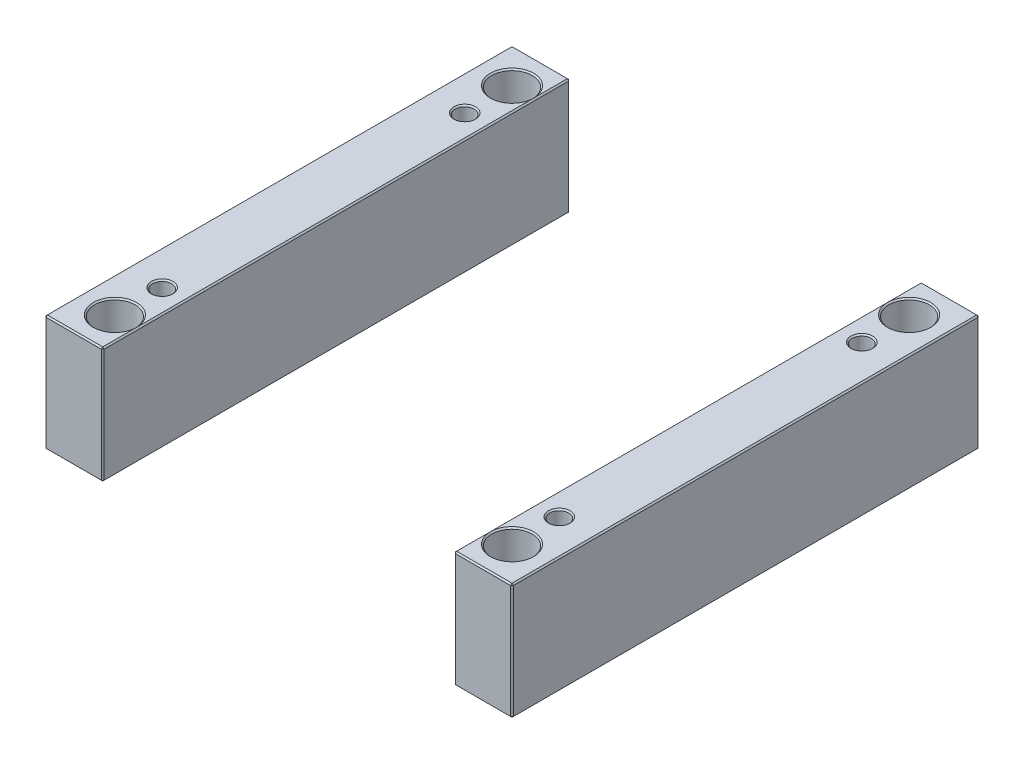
ISO-10303-21;
HEADER;
FILE_DESCRIPTION(('STEP AP214'),'2;1');
FILE_NAME('part.step','',(''),(''),'','','');
FILE_SCHEMA(('AUTOMOTIVE_DESIGN { 1 0 10303 214 1 1 1 1 }'));
ENDSEC;
DATA;
#1=APPLICATION_CONTEXT('core data for automotive mechanical design processes');
#2=APPLICATION_PROTOCOL_DEFINITION('international standard','automotive_design',2000,#1);
#3=PRODUCT_CONTEXT('',#1,'mechanical');
#4=PRODUCT('Part','Part','',(#3));
#5=PRODUCT_RELATED_PRODUCT_CATEGORY('part','',(#4));
#6=PRODUCT_DEFINITION_FORMATION('','',#4);
#7=PRODUCT_DEFINITION_CONTEXT('part definition',#1,'design');
#8=PRODUCT_DEFINITION('design','',#6,#7);
#9=PRODUCT_DEFINITION_SHAPE('','',#8);
#10=(LENGTH_UNIT() NAMED_UNIT(*) SI_UNIT(.MILLI.,.METRE.));
#11=(NAMED_UNIT(*) PLANE_ANGLE_UNIT() SI_UNIT($,.RADIAN.));
#12=(NAMED_UNIT(*) SI_UNIT($,.STERADIAN.) SOLID_ANGLE_UNIT());
#13=UNCERTAINTY_MEASURE_WITH_UNIT(LENGTH_MEASURE(1.E-05),#10,'distance_accuracy_value','');
#14=(GEOMETRIC_REPRESENTATION_CONTEXT(3) GLOBAL_UNCERTAINTY_ASSIGNED_CONTEXT((#13)) GLOBAL_UNIT_ASSIGNED_CONTEXT((#10,
#11,#12)) REPRESENTATION_CONTEXT('',''));
#15=CARTESIAN_POINT('',(0.,0.,0.));
#16=DIRECTION('',(0.,0.,1.));
#17=DIRECTION('',(1.,0.,0.));
#18=AXIS2_PLACEMENT_3D('',#15,#16,#17);
#19=CARTESIAN_POINT('',(-173.,86.,-173.));
#20=DIRECTION('',(0.,0.,1.));
#21=DIRECTION('',(1.,0.,0.));
#22=AXIS2_PLACEMENT_3D('',#19,#20,#21);
#23=PLANE('',#22);
#24=DIRECTION('',(-1.,0.,0.));
#25=VECTOR('',#24,1.);
#26=CARTESIAN_POINT('',(-173.,0.999999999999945,-173.));
#27=LINE('',#26,#25);
#28=CARTESIAN_POINT('',(-131.,0.999999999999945,-173.));
#29=VERTEX_POINT('',#28);
#30=CARTESIAN_POINT('',(-172.,0.999999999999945,-173.));
#31=VERTEX_POINT('',#30);
#32=EDGE_CURVE('P0_E151',#29,#31,#27,.T.);
#33=ORIENTED_EDGE('',*,*,#32,.T.);
#34=DIRECTION('',(0.,1.,0.));
#35=VECTOR('',#34,1.);
#36=CARTESIAN_POINT('',(-172.,86.,-173.));
#37=LINE('',#36,#35);
#38=CARTESIAN_POINT('',(-172.,85.,-173.));
#39=VERTEX_POINT('',#38);
#40=EDGE_CURVE('P0_E266',#31,#39,#37,.T.);
#41=ORIENTED_EDGE('',*,*,#40,.T.);
#42=DIRECTION('',(1.,0.,0.));
#43=VECTOR('',#42,1.);
#44=CARTESIAN_POINT('',(-173.,85.,-173.));
#45=LINE('',#44,#43);
#46=CARTESIAN_POINT('',(-131.,85.,-173.));
#47=VERTEX_POINT('',#46);
#48=EDGE_CURVE('P0_E264',#39,#47,#45,.T.);
#49=ORIENTED_EDGE('',*,*,#48,.T.);
#50=DIRECTION('',(0.,-1.,0.));
#51=VECTOR('',#50,1.);
#52=CARTESIAN_POINT('',(-131.,86.,-173.));
#53=LINE('',#52,#51);
#54=EDGE_CURVE('P0_E261',#47,#29,#53,.T.);
#55=ORIENTED_EDGE('',*,*,#54,.T.);
#56=EDGE_LOOP('',(#33,#41,#49,#55));
#57=FACE_BOUND('',#56,.T.);
#58=ADVANCED_FACE('P0_F16',(#57),#23,.F.);
#59=CARTESIAN_POINT('',(-173.,86.,173.));
#60=DIRECTION('',(1.,0.,0.));
#61=DIRECTION('',(0.,0.,-1.));
#62=AXIS2_PLACEMENT_3D('',#59,#60,#61);
#63=PLANE('',#62);
#64=DIRECTION('',(0.,1.,0.));
#65=VECTOR('',#64,1.);
#66=CARTESIAN_POINT('',(-173.,86.,172.));
#67=LINE('',#66,#65);
#68=CARTESIAN_POINT('',(-173.,0.999999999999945,172.));
#69=VERTEX_POINT('',#68);
#70=CARTESIAN_POINT('',(-173.,85.,172.));
#71=VERTEX_POINT('',#70);
#72=EDGE_CURVE('P0_E254',#69,#71,#67,.T.);
#73=ORIENTED_EDGE('',*,*,#72,.T.);
#74=DIRECTION('',(0.,0.,-1.));
#75=VECTOR('',#74,1.);
#76=CARTESIAN_POINT('',(-173.,85.,173.));
#77=LINE('',#76,#75);
#78=CARTESIAN_POINT('',(-173.,85.,-172.));
#79=VERTEX_POINT('',#78);
#80=EDGE_CURVE('P0_E259',#71,#79,#77,.T.);
#81=ORIENTED_EDGE('',*,*,#80,.T.);
#82=DIRECTION('',(0.,-1.,0.));
#83=VECTOR('',#82,1.);
#84=CARTESIAN_POINT('',(-173.,86.,-172.));
#85=LINE('',#84,#83);
#86=CARTESIAN_POINT('',(-173.,0.999999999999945,-172.));
#87=VERTEX_POINT('',#86);
#88=EDGE_CURVE('P0_E256',#79,#87,#85,.T.);
#89=ORIENTED_EDGE('',*,*,#88,.T.);
#90=DIRECTION('',(0.,0.,1.));
#91=VECTOR('',#90,1.);
#92=CARTESIAN_POINT('',(-173.,0.999999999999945,173.));
#93=LINE('',#92,#91);
#94=EDGE_CURVE('P0_E252',#87,#69,#93,.T.);
#95=ORIENTED_EDGE('',*,*,#94,.T.);
#96=EDGE_LOOP('',(#73,#81,#89,#95));
#97=FACE_BOUND('',#96,.T.);
#98=ADVANCED_FACE('P0_F340',(#97),#63,.F.);
#99=CARTESIAN_POINT('',(-173.,86.,173.));
#100=DIRECTION('',(0.,0.,-1.));
#101=DIRECTION('',(-1.,0.,0.));
#102=AXIS2_PLACEMENT_3D('',#99,#100,#101);
#103=PLANE('',#102);
#104=DIRECTION('',(-1.,0.,0.));
#105=VECTOR('',#104,1.);
#106=CARTESIAN_POINT('',(-173.,85.,173.));
#107=LINE('',#106,#105);
#108=CARTESIAN_POINT('',(-131.,85.,173.));
#109=VERTEX_POINT('',#108);
#110=CARTESIAN_POINT('',(-172.,85.,173.));
#111=VERTEX_POINT('',#110);
#112=EDGE_CURVE('P0_E273',#109,#111,#107,.T.);
#113=ORIENTED_EDGE('',*,*,#112,.T.);
#114=DIRECTION('',(0.,-1.,0.));
#115=VECTOR('',#114,1.);
#116=CARTESIAN_POINT('',(-172.,86.,173.));
#117=LINE('',#116,#115);
#118=CARTESIAN_POINT('',(-172.,0.999999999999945,173.));
#119=VERTEX_POINT('',#118);
#120=EDGE_CURVE('P0_E275',#111,#119,#117,.T.);
#121=ORIENTED_EDGE('',*,*,#120,.T.);
#122=DIRECTION('',(1.,0.,0.));
#123=VECTOR('',#122,1.);
#124=CARTESIAN_POINT('',(-130.,0.999999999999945,173.));
#125=LINE('',#124,#123);
#126=CARTESIAN_POINT('',(-131.,0.999999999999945,173.));
#127=VERTEX_POINT('',#126);
#128=EDGE_CURVE('P0_E271',#119,#127,#125,.T.);
#129=ORIENTED_EDGE('',*,*,#128,.T.);
#130=DIRECTION('',(0.,1.,0.));
#131=VECTOR('',#130,1.);
#132=CARTESIAN_POINT('',(-131.,86.,173.));
#133=LINE('',#132,#131);
#134=EDGE_CURVE('P0_E269',#127,#109,#133,.T.);
#135=ORIENTED_EDGE('',*,*,#134,.T.);
#136=EDGE_LOOP('',(#113,#121,#129,#135));
#137=FACE_BOUND('',#136,.T.);
#138=ADVANCED_FACE('P0_F395',(#137),#103,.F.);
#139=CARTESIAN_POINT('',(-130.,86.,-173.));
#140=DIRECTION('',(-1.,0.,0.));
#141=DIRECTION('',(0.,0.,1.));
#142=AXIS2_PLACEMENT_3D('',#139,#140,#141);
#143=PLANE('',#142);
#144=DIRECTION('',(0.,0.,1.));
#145=VECTOR('',#144,1.);
#146=CARTESIAN_POINT('',(-130.,85.,-173.));
#147=LINE('',#146,#145);
#148=CARTESIAN_POINT('',(-130.,85.,-172.));
#149=VERTEX_POINT('',#148);
#150=CARTESIAN_POINT('',(-130.,85.,172.));
#151=VERTEX_POINT('',#150);
#152=EDGE_CURVE('P0_E294',#149,#151,#147,.T.);
#153=ORIENTED_EDGE('',*,*,#152,.T.);
#154=DIRECTION('',(0.,-1.,0.));
#155=VECTOR('',#154,1.);
#156=CARTESIAN_POINT('',(-130.,86.,172.));
#157=LINE('',#156,#155);
#158=CARTESIAN_POINT('',(-130.,0.999999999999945,172.));
#159=VERTEX_POINT('',#158);
#160=EDGE_CURVE('P0_E206',#151,#159,#157,.T.);
#161=ORIENTED_EDGE('',*,*,#160,.T.);
#162=DIRECTION('',(0.,0.,-1.));
#163=VECTOR('',#162,1.);
#164=CARTESIAN_POINT('',(-130.,0.999999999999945,-173.));
#165=LINE('',#164,#163);
#166=CARTESIAN_POINT('',(-130.,0.999999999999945,-172.));
#167=VERTEX_POINT('',#166);
#168=EDGE_CURVE('P0_E290',#159,#167,#165,.T.);
#169=ORIENTED_EDGE('',*,*,#168,.T.);
#170=DIRECTION('',(0.,1.,0.));
#171=VECTOR('',#170,1.);
#172=CARTESIAN_POINT('',(-130.,86.,-172.));
#173=LINE('',#172,#171);
#174=EDGE_CURVE('P0_E292',#167,#149,#173,.T.);
#175=ORIENTED_EDGE('',*,*,#174,.T.);
#176=EDGE_LOOP('',(#153,#161,#169,#175));
#177=FACE_BOUND('',#176,.T.);
#178=ADVANCED_FACE('P0_F370',(#177),#143,.F.);
#179=CARTESIAN_POINT('',(0.,86.,0.));
#180=DIRECTION('',(0.,-1.,0.));
#181=DIRECTION('',(0.,0.,-1.));
#182=AXIS2_PLACEMENT_3D('',#179,#180,#181);
#183=PLANE('',#182);
#184=CARTESIAN_POINT('',(-147.,86.,112.));
#185=DIRECTION('',(0.,-1.,0.));
#186=DIRECTION('',(0.,0.,-1.));
#187=AXIS2_PLACEMENT_3D('',#184,#185,#186);
#188=CIRCLE('',#187,8.);
#189=CARTESIAN_POINT('',(-147.,86.,104.));
#190=VERTEX_POINT('',#189);
#191=EDGE_CURVE('P0_E209',#190,#190,#188,.T.);
#192=ORIENTED_EDGE('',*,*,#191,.T.);
#193=EDGE_LOOP('',(#192));
#194=FACE_BOUND('',#193,.T.);
#195=CARTESIAN_POINT('',(-147.,86.,-112.));
#196=DIRECTION('',(0.,-1.,0.));
#197=DIRECTION('',(0.,0.,-1.));
#198=AXIS2_PLACEMENT_3D('',#195,#196,#197);
#199=CIRCLE('',#198,8.);
#200=CARTESIAN_POINT('',(-147.,86.,-120.));
#201=VERTEX_POINT('',#200);
#202=EDGE_CURVE('P0_E205',#201,#201,#199,.T.);
#203=ORIENTED_EDGE('',*,*,#202,.T.);
#204=EDGE_LOOP('',(#203));
#205=FACE_BOUND('',#204,.T.);
#206=DIRECTION('',(0.,0.,-1.));
#207=VECTOR('',#206,1.);
#208=CARTESIAN_POINT('',(-131.,86.,0.));
#209=LINE('',#208,#207);
#210=CARTESIAN_POINT('',(-131.,86.,147.));
#211=VERTEX_POINT('',#210);
#212=CARTESIAN_POINT('',(-131.,86.,-147.));
#213=VERTEX_POINT('',#212);
#214=EDGE_CURVE('P0_E283',#211,#213,#209,.T.);
#215=ORIENTED_EDGE('',*,*,#214,.T.);
#216=CARTESIAN_POINT('',(-147.,86.,-147.));
#217=DIRECTION('',(0.,-1.,0.));
#218=DIRECTION('',(0.,0.,-1.));
#219=AXIS2_PLACEMENT_3D('',#216,#217,#218);
#220=CIRCLE('',#219,16.);
#221=EDGE_CURVE('P0_E29',#213,#213,#220,.T.);
#222=ORIENTED_EDGE('',*,*,#221,.T.);
#223=CARTESIAN_POINT('',(-131.,86.,-172.));
#224=VERTEX_POINT('',#223);
#225=EDGE_CURVE('P0_E278',#213,#224,#209,.T.);
#226=ORIENTED_EDGE('',*,*,#225,.T.);
#227=DIRECTION('',(-1.,0.,0.));
#228=VECTOR('',#227,1.);
#229=CARTESIAN_POINT('',(-1.11022302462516E-13,86.,-172.));
#230=LINE('',#229,#228);
#231=CARTESIAN_POINT('',(-172.,86.,-172.));
#232=VERTEX_POINT('',#231);
#233=EDGE_CURVE('P0_E282',#224,#232,#230,.T.);
#234=ORIENTED_EDGE('',*,*,#233,.T.);
#235=DIRECTION('',(0.,0.,1.));
#236=VECTOR('',#235,1.);
#237=CARTESIAN_POINT('',(-172.,86.,0.));
#238=LINE('',#237,#236);
#239=CARTESIAN_POINT('',(-172.,86.,172.));
#240=VERTEX_POINT('',#239);
#241=EDGE_CURVE('P0_E285',#232,#240,#238,.T.);
#242=ORIENTED_EDGE('',*,*,#241,.T.);
#243=DIRECTION('',(1.,0.,0.));
#244=VECTOR('',#243,1.);
#245=CARTESIAN_POINT('',(1.11022302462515E-13,86.,172.));
#246=LINE('',#245,#244);
#247=CARTESIAN_POINT('',(-131.,86.,172.));
#248=VERTEX_POINT('',#247);
#249=EDGE_CURVE('P0_E287',#240,#248,#246,.T.);
#250=ORIENTED_EDGE('',*,*,#249,.T.);
#251=EDGE_CURVE('P0_E279',#248,#211,#209,.T.);
#252=ORIENTED_EDGE('',*,*,#251,.T.);
#253=CARTESIAN_POINT('',(-147.,86.,147.));
#254=DIRECTION('',(0.,-1.,0.));
#255=DIRECTION('',(0.,0.,-1.));
#256=AXIS2_PLACEMENT_3D('',#253,#254,#255);
#257=CIRCLE('',#256,16.);
#258=EDGE_CURVE('P0_E34',#211,#211,#257,.T.);
#259=ORIENTED_EDGE('',*,*,#258,.T.);
#260=EDGE_LOOP('',(#215,#222,#226,#234,#242,#250,#252,#259));
#261=FACE_BOUND('',#260,.T.);
#262=ADVANCED_FACE('P0_F354',(#194,#205,#261),#183,.F.);
#263=CARTESIAN_POINT('',(0.,0.,0.));
#264=DIRECTION('',(0.,-1.,0.));
#265=DIRECTION('',(0.,0.,-1.));
#266=AXIS2_PLACEMENT_3D('',#263,#264,#265);
#267=PLANE('',#266);
#268=CARTESIAN_POINT('',(-147.,0.,-112.));
#269=DIRECTION('',(0.,-1.,0.));
#270=DIRECTION('',(0.,0.,-1.));
#271=AXIS2_PLACEMENT_3D('',#268,#269,#270);
#272=CIRCLE('',#271,8.);
#273=CARTESIAN_POINT('',(-147.,0.,-120.));
#274=VERTEX_POINT('',#273);
#275=EDGE_CURVE('P0_E243',#274,#274,#272,.F.);
#276=ORIENTED_EDGE('',*,*,#275,.T.);
#277=EDGE_LOOP('',(#276));
#278=FACE_BOUND('',#277,.T.);
#279=CARTESIAN_POINT('',(-147.,0.,112.));
#280=DIRECTION('',(0.,-1.,0.));
#281=DIRECTION('',(0.,0.,-1.));
#282=AXIS2_PLACEMENT_3D('',#279,#280,#281);
#283=CIRCLE('',#282,8.);
#284=CARTESIAN_POINT('',(-147.,0.,104.));
#285=VERTEX_POINT('',#284);
#286=EDGE_CURVE('P0_E240',#285,#285,#283,.F.);
#287=ORIENTED_EDGE('',*,*,#286,.T.);
#288=EDGE_LOOP('',(#287));
#289=FACE_BOUND('',#288,.T.);
#290=DIRECTION('',(0.,0.,1.));
#291=VECTOR('',#290,1.);
#292=CARTESIAN_POINT('',(-131.,0.,173.));
#293=LINE('',#292,#291);
#294=CARTESIAN_POINT('',(-131.,0.,-172.));
#295=VERTEX_POINT('',#294);
#296=CARTESIAN_POINT('',(-131.,0.,-147.));
#297=VERTEX_POINT('',#296);
#298=EDGE_CURVE('P0_E120',#295,#297,#293,.T.);
#299=ORIENTED_EDGE('',*,*,#298,.T.);
#300=CARTESIAN_POINT('',(-147.,0.,-147.));
#301=DIRECTION('',(0.,-1.,0.));
#302=DIRECTION('',(0.,0.,-1.));
#303=AXIS2_PLACEMENT_3D('',#300,#301,#302);
#304=CIRCLE('',#303,16.);
#305=EDGE_CURVE('P0_E218',#297,#297,#304,.F.);
#306=ORIENTED_EDGE('',*,*,#305,.T.);
#307=CARTESIAN_POINT('',(-131.,0.,147.));
#308=VERTEX_POINT('',#307);
#309=EDGE_CURVE('P0_E138',#297,#308,#293,.T.);
#310=ORIENTED_EDGE('',*,*,#309,.T.);
#311=CARTESIAN_POINT('',(-147.,0.,147.));
#312=DIRECTION('',(0.,-1.,0.));
#313=DIRECTION('',(0.,0.,-1.));
#314=AXIS2_PLACEMENT_3D('',#311,#312,#313);
#315=CIRCLE('',#314,16.);
#316=EDGE_CURVE('P0_E215',#308,#308,#315,.F.);
#317=ORIENTED_EDGE('',*,*,#316,.T.);
#318=CARTESIAN_POINT('',(-131.,0.,172.));
#319=VERTEX_POINT('',#318);
#320=EDGE_CURVE('P0_E140',#308,#319,#293,.T.);
#321=ORIENTED_EDGE('',*,*,#320,.T.);
#322=DIRECTION('',(-1.,0.,0.));
#323=VECTOR('',#322,1.);
#324=CARTESIAN_POINT('',(-173.,0.,172.));
#325=LINE('',#324,#323);
#326=CARTESIAN_POINT('',(-172.,0.,172.));
#327=VERTEX_POINT('',#326);
#328=EDGE_CURVE('P0_E126',#319,#327,#325,.T.);
#329=ORIENTED_EDGE('',*,*,#328,.T.);
#330=DIRECTION('',(0.,0.,-1.));
#331=VECTOR('',#330,1.);
#332=CARTESIAN_POINT('',(-172.,0.,-173.));
#333=LINE('',#332,#331);
#334=CARTESIAN_POINT('',(-172.,0.,-172.));
#335=VERTEX_POINT('',#334);
#336=EDGE_CURVE('P0_E122',#327,#335,#333,.T.);
#337=ORIENTED_EDGE('',*,*,#336,.T.);
#338=DIRECTION('',(1.,0.,0.));
#339=VECTOR('',#338,1.);
#340=CARTESIAN_POINT('',(-130.,0.,-172.));
#341=LINE('',#340,#339);
#342=EDGE_CURVE('P0_E116',#335,#295,#341,.T.);
#343=ORIENTED_EDGE('',*,*,#342,.T.);
#344=EDGE_LOOP('',(#299,#306,#310,#317,#321,#329,#337,#343));
#345=FACE_BOUND('',#344,.T.);
#346=ADVANCED_FACE('P0_F118',(#278,#289,#345),#267,.T.);
#347=CARTESIAN_POINT('',(-147.,0.,-112.));
#348=DIRECTION('',(0.,1.,0.));
#349=DIRECTION('',(0.,0.,1.));
#350=AXIS2_PLACEMENT_3D('',#347,#348,#349);
#351=CYLINDRICAL_SURFACE('',#350,7.);
#352=CARTESIAN_POINT('',(-147.,85.,-112.));
#353=DIRECTION('',(0.,-1.,0.));
#354=DIRECTION('',(0.,0.,-1.));
#355=AXIS2_PLACEMENT_3D('',#352,#353,#354);
#356=CIRCLE('',#355,7.);
#357=CARTESIAN_POINT('',(-147.,85.,-119.));
#358=VERTEX_POINT('',#357);
#359=EDGE_CURVE('P0_E212',#358,#358,#356,.F.);
#360=ORIENTED_EDGE('',*,*,#359,.T.);
#361=EDGE_LOOP('',(#360));
#362=FACE_BOUND('',#361,.T.);
#363=CARTESIAN_POINT('',(-147.,1.00000000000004,-112.));
#364=DIRECTION('',(0.,-1.,0.));
#365=DIRECTION('',(0.,0.,-1.));
#366=AXIS2_PLACEMENT_3D('',#363,#364,#365);
#367=CIRCLE('',#366,7.);
#368=CARTESIAN_POINT('',(-147.,1.00000000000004,-119.));
#369=VERTEX_POINT('',#368);
#370=EDGE_CURVE('P0_E246',#369,#369,#367,.T.);
#371=ORIENTED_EDGE('',*,*,#370,.T.);
#372=EDGE_LOOP('',(#371));
#373=FACE_BOUND('',#372,.T.);
#374=ADVANCED_FACE('P0_F445',(#362,#373),#351,.F.);
#375=CARTESIAN_POINT('',(-147.,0.,112.));
#376=DIRECTION('',(0.,1.,0.));
#377=DIRECTION('',(0.,0.,1.));
#378=AXIS2_PLACEMENT_3D('',#375,#376,#377);
#379=CYLINDRICAL_SURFACE('',#378,7.);
#380=CARTESIAN_POINT('',(-147.,85.,112.));
#381=DIRECTION('',(0.,-1.,0.));
#382=DIRECTION('',(0.,0.,-1.));
#383=AXIS2_PLACEMENT_3D('',#380,#381,#382);
#384=CIRCLE('',#383,7.);
#385=CARTESIAN_POINT('',(-147.,85.,105.));
#386=VERTEX_POINT('',#385);
#387=EDGE_CURVE('P0_E202',#386,#386,#384,.F.);
#388=ORIENTED_EDGE('',*,*,#387,.T.);
#389=EDGE_LOOP('',(#388));
#390=FACE_BOUND('',#389,.T.);
#391=CARTESIAN_POINT('',(-147.,1.00000000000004,112.));
#392=DIRECTION('',(0.,-1.,0.));
#393=DIRECTION('',(0.,0.,-1.));
#394=AXIS2_PLACEMENT_3D('',#391,#392,#393);
#395=CIRCLE('',#394,7.);
#396=CARTESIAN_POINT('',(-147.,1.00000000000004,105.));
#397=VERTEX_POINT('',#396);
#398=EDGE_CURVE('P0_E249',#397,#397,#395,.T.);
#399=ORIENTED_EDGE('',*,*,#398,.T.);
#400=EDGE_LOOP('',(#399));
#401=FACE_BOUND('',#400,.T.);
#402=ADVANCED_FACE('P0_F403',(#390,#401),#379,.F.);
#403=CARTESIAN_POINT('',(-147.,0.,-112.));
#404=DIRECTION('',(0.,-1.,0.));
#405=DIRECTION('',(0.,0.,-1.));
#406=AXIS2_PLACEMENT_3D('',#403,#404,#405);
#407=CONICAL_SURFACE('',#406,8.,0.78539816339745);
#408=ORIENTED_EDGE('',*,*,#370,.F.);
#409=EDGE_LOOP('',(#408));
#410=FACE_BOUND('',#409,.T.);
#411=ORIENTED_EDGE('',*,*,#275,.F.);
#412=EDGE_LOOP('',(#411));
#413=FACE_BOUND('',#412,.T.);
#414=ADVANCED_FACE('P0_F399',(#410,#413),#407,.F.);
#415=CARTESIAN_POINT('',(-147.,0.,112.));
#416=DIRECTION('',(0.,-1.,0.));
#417=DIRECTION('',(0.,0.,-1.));
#418=AXIS2_PLACEMENT_3D('',#415,#416,#417);
#419=CONICAL_SURFACE('',#418,8.,0.78539816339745);
#420=ORIENTED_EDGE('',*,*,#398,.F.);
#421=EDGE_LOOP('',(#420));
#422=FACE_BOUND('',#421,.T.);
#423=ORIENTED_EDGE('',*,*,#286,.F.);
#424=EDGE_LOOP('',(#423));
#425=FACE_BOUND('',#424,.T.);
#426=ADVANCED_FACE('P0_F402',(#422,#425),#419,.F.);
#427=CARTESIAN_POINT('',(-130.,86.,172.));
#428=DIRECTION('',(-0.707106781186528,0.,-0.707106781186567));
#429=DIRECTION('',(0.,-1.,0.));
#430=AXIS2_PLACEMENT_3D('',#427,#428,#429);
#431=PLANE('',#430);
#432=DIRECTION('',(-0.707106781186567,0.,0.707106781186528));
#433=VECTOR('',#432,1.);
#434=CARTESIAN_POINT('',(-130.5,85.,172.5));
#435=LINE('',#434,#433);
#436=EDGE_CURVE('P0_E199',#109,#151,#435,.F.);
#437=ORIENTED_EDGE('',*,*,#436,.F.);
#438=ORIENTED_EDGE('',*,*,#134,.F.);
#439=DIRECTION('',(0.707106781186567,0.,-0.707106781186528));
#440=VECTOR('',#439,1.);
#441=CARTESIAN_POINT('',(-131.,0.999999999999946,173.));
#442=LINE('',#441,#440);
#443=EDGE_CURVE('P0_E196',#159,#127,#442,.F.);
#444=ORIENTED_EDGE('',*,*,#443,.F.);
#445=ORIENTED_EDGE('',*,*,#160,.F.);
#446=EDGE_LOOP('',(#437,#438,#444,#445));
#447=FACE_BOUND('',#446,.T.);
#448=ADVANCED_FACE('P0_F367',(#447),#431,.F.);
#449=CARTESIAN_POINT('',(-131.,86.,172.));
#450=DIRECTION('',(0.577350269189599,0.577350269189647,0.577350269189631));
#451=DIRECTION('',(0.,-0.707106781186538,0.707106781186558));
#452=AXIS2_PLACEMENT_3D('',#449,#450,#451);
#453=PLANE('',#452);
#454=DIRECTION('',(0.,0.707106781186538,-0.707106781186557));
#455=VECTOR('',#454,1.);
#456=CARTESIAN_POINT('',(-131.,86.,172.));
#457=LINE('',#456,#455);
#458=EDGE_CURVE('P0_E190',#109,#248,#457,.T.);
#459=ORIENTED_EDGE('',*,*,#458,.F.);
#460=ORIENTED_EDGE('',*,*,#436,.T.);
#461=DIRECTION('',(0.707106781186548,-0.707106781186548,0.));
#462=VECTOR('',#461,1.);
#463=CARTESIAN_POINT('',(-131.,86.,172.));
#464=LINE('',#463,#462);
#465=EDGE_CURVE('P0_E193',#248,#151,#464,.T.);
#466=ORIENTED_EDGE('',*,*,#465,.F.);
#467=EDGE_LOOP('',(#459,#460,#466));
#468=FACE_BOUND('',#467,.T.);
#469=ADVANCED_FACE('P0_F362',(#468),#453,.T.);
#470=CARTESIAN_POINT('',(-131.,0.999999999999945,173.));
#471=DIRECTION('',(0.577350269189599,-0.577350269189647,0.577350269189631));
#472=DIRECTION('',(0.,-0.707106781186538,-0.707106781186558));
#473=AXIS2_PLACEMENT_3D('',#470,#471,#472);
#474=PLANE('',#473);
#475=DIRECTION('',(0.707106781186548,0.707106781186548,0.));
#476=VECTOR('',#475,1.);
#477=CARTESIAN_POINT('',(-130.5,0.500000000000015,172.));
#478=LINE('',#477,#476);
#479=EDGE_CURVE('P0_E185',#159,#319,#478,.F.);
#480=ORIENTED_EDGE('',*,*,#479,.F.);
#481=ORIENTED_EDGE('',*,*,#443,.T.);
#482=DIRECTION('',(0.,-0.707106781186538,-0.707106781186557));
#483=VECTOR('',#482,1.);
#484=CARTESIAN_POINT('',(-131.,0.999999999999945,173.));
#485=LINE('',#484,#483);
#486=EDGE_CURVE('P0_E187',#319,#127,#485,.F.);
#487=ORIENTED_EDGE('',*,*,#486,.F.);
#488=EDGE_LOOP('',(#480,#481,#487));
#489=FACE_BOUND('',#488,.T.);
#490=ADVANCED_FACE('P0_F492',(#489),#474,.T.);
#491=CARTESIAN_POINT('',(-131.,86.,0.));
#492=DIRECTION('',(-0.707106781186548,-0.707106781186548,0.));
#493=DIRECTION('',(0.,0.,-1.));
#494=AXIS2_PLACEMENT_3D('',#491,#492,#493);
#495=PLANE('',#494);
#496=ORIENTED_EDGE('',*,*,#465,.T.);
#497=ORIENTED_EDGE('',*,*,#152,.F.);
#498=DIRECTION('',(-0.707106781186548,0.707106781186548,0.));
#499=VECTOR('',#498,1.);
#500=CARTESIAN_POINT('',(-130.5,85.5,-172.));
#501=LINE('',#500,#499);
#502=EDGE_CURVE('P0_E179',#224,#149,#501,.F.);
#503=ORIENTED_EDGE('',*,*,#502,.F.);
#504=ORIENTED_EDGE('',*,*,#225,.F.);
#505=ORIENTED_EDGE('',*,*,#214,.F.);
#506=ORIENTED_EDGE('',*,*,#251,.F.);
#507=EDGE_LOOP('',(#496,#497,#503,#504,#505,#506));
#508=FACE_BOUND('',#507,.T.);
#509=ADVANCED_FACE('P0_F358',(#508),#495,.F.);
#510=CARTESIAN_POINT('',(1.11022302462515E-13,86.,172.));
#511=DIRECTION('',(0.,-0.707106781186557,-0.707106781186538));
#512=DIRECTION('',(1.,0.,0.));
#513=AXIS2_PLACEMENT_3D('',#510,#511,#512);
#514=PLANE('',#513);
#515=ORIENTED_EDGE('',*,*,#458,.T.);
#516=ORIENTED_EDGE('',*,*,#249,.F.);
#517=DIRECTION('',(0.,-0.707106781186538,0.707106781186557));
#518=VECTOR('',#517,1.);
#519=CARTESIAN_POINT('',(-172.,85.5,172.5));
#520=LINE('',#519,#518);
#521=EDGE_CURVE('P0_E176',#111,#240,#520,.F.);
#522=ORIENTED_EDGE('',*,*,#521,.F.);
#523=ORIENTED_EDGE('',*,*,#112,.F.);
#524=EDGE_LOOP('',(#515,#516,#522,#523));
#525=FACE_BOUND('',#524,.T.);
#526=ADVANCED_FACE('P0_F351',(#525),#514,.F.);
#527=CARTESIAN_POINT('',(-172.,86.,173.));
#528=DIRECTION('',(0.707106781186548,0.,-0.707106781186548));
#529=DIRECTION('',(0.,-1.,0.));
#530=AXIS2_PLACEMENT_3D('',#527,#528,#529);
#531=PLANE('',#530);
#532=DIRECTION('',(0.707106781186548,0.,0.707106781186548));
#533=VECTOR('',#532,1.);
#534=CARTESIAN_POINT('',(-172.,0.999999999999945,173.));
#535=LINE('',#534,#533);
#536=EDGE_CURVE('P0_E170',#119,#69,#535,.F.);
#537=ORIENTED_EDGE('',*,*,#536,.F.);
#538=ORIENTED_EDGE('',*,*,#120,.F.);
#539=DIRECTION('',(-0.707106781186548,0.,-0.707106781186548));
#540=VECTOR('',#539,1.);
#541=CARTESIAN_POINT('',(-173.,85.,172.));
#542=LINE('',#541,#540);
#543=EDGE_CURVE('P0_E173',#71,#111,#542,.F.);
#544=ORIENTED_EDGE('',*,*,#543,.F.);
#545=ORIENTED_EDGE('',*,*,#72,.F.);
#546=EDGE_LOOP('',(#537,#538,#544,#545));
#547=FACE_BOUND('',#546,.T.);
#548=ADVANCED_FACE('P0_F345',(#547),#531,.F.);
#549=CARTESIAN_POINT('',(-173.,0.999999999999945,173.));
#550=DIRECTION('',(0.,-0.707106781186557,0.707106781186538));
#551=DIRECTION('',(-1.,0.,0.));
#552=AXIS2_PLACEMENT_3D('',#549,#550,#551);
#553=PLANE('',#552);
#554=ORIENTED_EDGE('',*,*,#486,.T.);
#555=ORIENTED_EDGE('',*,*,#128,.F.);
#556=DIRECTION('',(0.,0.707106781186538,0.707106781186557));
#557=VECTOR('',#556,1.);
#558=CARTESIAN_POINT('',(-172.,0.999999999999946,173.));
#559=LINE('',#558,#557);
#560=EDGE_CURVE('P0_E148',#327,#119,#559,.T.);
#561=ORIENTED_EDGE('',*,*,#560,.F.);
#562=ORIENTED_EDGE('',*,*,#328,.F.);
#563=EDGE_LOOP('',(#554,#555,#561,#562));
#564=FACE_BOUND('',#563,.T.);
#565=ADVANCED_FACE('P0_F434',(#564),#553,.T.);
#566=CARTESIAN_POINT('',(-130.,0.999999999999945,-173.));
#567=DIRECTION('',(0.707106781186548,-0.707106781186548,0.));
#568=DIRECTION('',(0.,0.,1.));
#569=AXIS2_PLACEMENT_3D('',#566,#567,#568);
#570=PLANE('',#569);
#571=ORIENTED_EDGE('',*,*,#479,.T.);
#572=ORIENTED_EDGE('',*,*,#320,.F.);
#573=ORIENTED_EDGE('',*,*,#309,.F.);
#574=ORIENTED_EDGE('',*,*,#298,.F.);
#575=DIRECTION('',(-0.707106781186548,-0.707106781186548,0.));
#576=VECTOR('',#575,1.);
#577=CARTESIAN_POINT('',(-131.,0.,-172.));
#578=LINE('',#577,#576);
#579=EDGE_CURVE('P0_E134',#167,#295,#578,.T.);
#580=ORIENTED_EDGE('',*,*,#579,.F.);
#581=ORIENTED_EDGE('',*,*,#168,.F.);
#582=EDGE_LOOP('',(#571,#572,#573,#574,#580,#581));
#583=FACE_BOUND('',#582,.T.);
#584=ADVANCED_FACE('P0_F133',(#583),#570,.T.);
#585=CARTESIAN_POINT('',(-131.,86.,-173.));
#586=DIRECTION('',(-0.707106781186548,0.,0.707106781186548));
#587=DIRECTION('',(0.,-1.,0.));
#588=AXIS2_PLACEMENT_3D('',#585,#586,#587);
#589=PLANE('',#588);
#590=DIRECTION('',(0.707106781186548,0.,0.707106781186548));
#591=VECTOR('',#590,1.);
#592=CARTESIAN_POINT('',(-131.,85.,-173.));
#593=LINE('',#592,#591);
#594=EDGE_CURVE('P0_E182',#149,#47,#593,.F.);
#595=ORIENTED_EDGE('',*,*,#594,.F.);
#596=ORIENTED_EDGE('',*,*,#174,.F.);
#597=DIRECTION('',(-0.707106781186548,0.,-0.707106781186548));
#598=VECTOR('',#597,1.);
#599=CARTESIAN_POINT('',(-130.5,0.999999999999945,-172.5));
#600=LINE('',#599,#598);
#601=EDGE_CURVE('P0_E147',#29,#167,#600,.F.);
#602=ORIENTED_EDGE('',*,*,#601,.F.);
#603=ORIENTED_EDGE('',*,*,#54,.F.);
#604=EDGE_LOOP('',(#595,#596,#602,#603));
#605=FACE_BOUND('',#604,.T.);
#606=ADVANCED_FACE('P0_F375',(#605),#589,.F.);
#607=CARTESIAN_POINT('',(-131.,85.,-173.));
#608=DIRECTION('',(0.57735026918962,0.577350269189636,-0.57735026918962));
#609=DIRECTION('',(0.,0.707106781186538,0.707106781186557));
#610=AXIS2_PLACEMENT_3D('',#607,#608,#609);
#611=PLANE('',#610);
#612=ORIENTED_EDGE('',*,*,#502,.T.);
#613=ORIENTED_EDGE('',*,*,#594,.T.);
#614=DIRECTION('',(0.,-0.707106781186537,-0.707106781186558));
#615=VECTOR('',#614,1.);
#616=CARTESIAN_POINT('',(-131.,85.,-173.));
#617=LINE('',#616,#615);
#618=EDGE_CURVE('P0_E165',#224,#47,#617,.T.);
#619=ORIENTED_EDGE('',*,*,#618,.F.);
#620=EDGE_LOOP('',(#612,#613,#619));
#621=FACE_BOUND('',#620,.T.);
#622=ADVANCED_FACE('P0_F377',(#621),#611,.T.);
#623=CARTESIAN_POINT('',(-173.,85.,172.));
#624=DIRECTION('',(-0.57735026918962,0.577350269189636,0.57735026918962));
#625=DIRECTION('',(0.,-0.707106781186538,0.707106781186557));
#626=AXIS2_PLACEMENT_3D('',#623,#624,#625);
#627=PLANE('',#626);
#628=ORIENTED_EDGE('',*,*,#543,.T.);
#629=ORIENTED_EDGE('',*,*,#521,.T.);
#630=DIRECTION('',(0.707106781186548,0.707106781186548,0.));
#631=VECTOR('',#630,1.);
#632=CARTESIAN_POINT('',(-173.,85.,172.));
#633=LINE('',#632,#631);
#634=EDGE_CURVE('P0_E156',#71,#240,#633,.T.);
#635=ORIENTED_EDGE('',*,*,#634,.F.);
#636=EDGE_LOOP('',(#628,#629,#635));
#637=FACE_BOUND('',#636,.T.);
#638=ADVANCED_FACE('P0_F348',(#637),#627,.T.);
#639=CARTESIAN_POINT('',(-172.,0.999999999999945,173.));
#640=DIRECTION('',(-0.57735026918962,-0.577350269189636,0.57735026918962));
#641=DIRECTION('',(0.,-0.707106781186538,-0.707106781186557));
#642=AXIS2_PLACEMENT_3D('',#639,#640,#641);
#643=PLANE('',#642);
#644=ORIENTED_EDGE('',*,*,#560,.T.);
#645=ORIENTED_EDGE('',*,*,#536,.T.);
#646=DIRECTION('',(0.707106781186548,-0.707106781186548,0.));
#647=VECTOR('',#646,1.);
#648=CARTESIAN_POINT('',(-172.5,0.499999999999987,172.));
#649=LINE('',#648,#647);
#650=EDGE_CURVE('P0_E152',#327,#69,#649,.F.);
#651=ORIENTED_EDGE('',*,*,#650,.F.);
#652=EDGE_LOOP('',(#644,#645,#651));
#653=FACE_BOUND('',#652,.T.);
#654=ADVANCED_FACE('P0_F386',(#653),#643,.T.);
#655=CARTESIAN_POINT('',(-131.,0.,-172.));
#656=DIRECTION('',(0.57735026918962,-0.577350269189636,-0.57735026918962));
#657=DIRECTION('',(0.,0.707106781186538,-0.707106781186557));
#658=AXIS2_PLACEMENT_3D('',#655,#656,#657);
#659=PLANE('',#658);
#660=ORIENTED_EDGE('',*,*,#601,.T.);
#661=ORIENTED_EDGE('',*,*,#579,.T.);
#662=DIRECTION('',(0.,0.707106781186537,-0.707106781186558));
#663=VECTOR('',#662,1.);
#664=CARTESIAN_POINT('',(-131.,0.,-172.));
#665=LINE('',#664,#663);
#666=EDGE_CURVE('P0_E144',#29,#295,#665,.F.);
#667=ORIENTED_EDGE('',*,*,#666,.F.);
#668=EDGE_LOOP('',(#660,#661,#667));
#669=FACE_BOUND('',#668,.T.);
#670=ADVANCED_FACE('P0_F143',(#669),#659,.T.);
#671=CARTESIAN_POINT('',(-1.11022302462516E-13,86.,-172.));
#672=DIRECTION('',(0.,-0.707106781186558,0.707106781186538));
#673=DIRECTION('',(-1.,0.,0.));
#674=AXIS2_PLACEMENT_3D('',#671,#672,#673);
#675=PLANE('',#674);
#676=ORIENTED_EDGE('',*,*,#618,.T.);
#677=ORIENTED_EDGE('',*,*,#48,.F.);
#678=DIRECTION('',(0.,0.707106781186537,0.707106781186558));
#679=VECTOR('',#678,1.);
#680=CARTESIAN_POINT('',(-172.,85.,-173.));
#681=LINE('',#680,#679);
#682=EDGE_CURVE('P0_E153',#232,#39,#681,.F.);
#683=ORIENTED_EDGE('',*,*,#682,.F.);
#684=ORIENTED_EDGE('',*,*,#233,.F.);
#685=EDGE_LOOP('',(#676,#677,#683,#684));
#686=FACE_BOUND('',#685,.T.);
#687=ADVANCED_FACE('P0_F323',(#686),#675,.F.);
#688=CARTESIAN_POINT('',(-172.,86.,0.));
#689=DIRECTION('',(0.707106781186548,-0.707106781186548,0.));
#690=DIRECTION('',(0.,0.,1.));
#691=AXIS2_PLACEMENT_3D('',#688,#689,#690);
#692=PLANE('',#691);
#693=ORIENTED_EDGE('',*,*,#634,.T.);
#694=ORIENTED_EDGE('',*,*,#241,.F.);
#695=DIRECTION('',(-0.707106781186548,-0.707106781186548,0.));
#696=VECTOR('',#695,1.);
#697=CARTESIAN_POINT('',(-172.5,85.5,-172.));
#698=LINE('',#697,#696);
#699=EDGE_CURVE('P0_E159',#79,#232,#698,.F.);
#700=ORIENTED_EDGE('',*,*,#699,.F.);
#701=ORIENTED_EDGE('',*,*,#80,.F.);
#702=EDGE_LOOP('',(#693,#694,#700,#701));
#703=FACE_BOUND('',#702,.T.);
#704=ADVANCED_FACE('P0_F317',(#703),#692,.F.);
#705=CARTESIAN_POINT('',(-173.,0.999999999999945,173.));
#706=DIRECTION('',(-0.707106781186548,-0.707106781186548,0.));
#707=DIRECTION('',(0.,0.,-1.));
#708=AXIS2_PLACEMENT_3D('',#705,#706,#707);
#709=PLANE('',#708);
#710=ORIENTED_EDGE('',*,*,#650,.T.);
#711=ORIENTED_EDGE('',*,*,#94,.F.);
#712=DIRECTION('',(-0.707106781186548,0.707106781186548,0.));
#713=VECTOR('',#712,1.);
#714=CARTESIAN_POINT('',(-173.,0.999999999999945,-172.));
#715=LINE('',#714,#713);
#716=EDGE_CURVE('P0_E304',#335,#87,#715,.T.);
#717=ORIENTED_EDGE('',*,*,#716,.F.);
#718=ORIENTED_EDGE('',*,*,#336,.F.);
#719=EDGE_LOOP('',(#710,#711,#717,#718));
#720=FACE_BOUND('',#719,.T.);
#721=ADVANCED_FACE('P0_F336',(#720),#709,.T.);
#722=CARTESIAN_POINT('',(-173.,0.999999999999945,-173.));
#723=DIRECTION('',(0.,-0.707106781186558,-0.707106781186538));
#724=DIRECTION('',(1.,0.,0.));
#725=AXIS2_PLACEMENT_3D('',#722,#723,#724);
#726=PLANE('',#725);
#727=ORIENTED_EDGE('',*,*,#666,.T.);
#728=ORIENTED_EDGE('',*,*,#342,.F.);
#729=DIRECTION('',(0.,-0.707106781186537,0.707106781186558));
#730=VECTOR('',#729,1.);
#731=CARTESIAN_POINT('',(-172.,0.499999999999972,-172.5));
#732=LINE('',#731,#730);
#733=EDGE_CURVE('P0_E302',#31,#335,#732,.T.);
#734=ORIENTED_EDGE('',*,*,#733,.F.);
#735=ORIENTED_EDGE('',*,*,#32,.F.);
#736=EDGE_LOOP('',(#727,#728,#734,#735));
#737=FACE_BOUND('',#736,.T.);
#738=ADVANCED_FACE('P0_F150',(#737),#726,.T.);
#739=CARTESIAN_POINT('',(-172.,85.,-173.));
#740=DIRECTION('',(-0.57735026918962,0.577350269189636,-0.57735026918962));
#741=DIRECTION('',(0.,0.707106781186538,0.707106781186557));
#742=AXIS2_PLACEMENT_3D('',#739,#740,#741);
#743=PLANE('',#742);
#744=ORIENTED_EDGE('',*,*,#699,.T.);
#745=ORIENTED_EDGE('',*,*,#682,.T.);
#746=DIRECTION('',(0.707106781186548,0.,-0.707106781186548));
#747=VECTOR('',#746,1.);
#748=CARTESIAN_POINT('',(-172.,85.,-173.));
#749=LINE('',#748,#747);
#750=EDGE_CURVE('P0_E300',#79,#39,#749,.T.);
#751=ORIENTED_EDGE('',*,*,#750,.F.);
#752=EDGE_LOOP('',(#744,#745,#751));
#753=FACE_BOUND('',#752,.T.);
#754=ADVANCED_FACE('P0_F310',(#753),#743,.T.);
#755=CARTESIAN_POINT('',(-173.,0.999999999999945,-172.));
#756=DIRECTION('',(-0.57735026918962,-0.577350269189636,-0.57735026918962));
#757=DIRECTION('',(0.,0.707106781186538,-0.707106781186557));
#758=AXIS2_PLACEMENT_3D('',#755,#756,#757);
#759=PLANE('',#758);
#760=ORIENTED_EDGE('',*,*,#733,.T.);
#761=ORIENTED_EDGE('',*,*,#716,.T.);
#762=DIRECTION('',(-0.707106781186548,0.,0.707106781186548));
#763=VECTOR('',#762,1.);
#764=CARTESIAN_POINT('',(-173.,0.999999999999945,-172.));
#765=LINE('',#764,#763);
#766=EDGE_CURVE('P0_E298',#31,#87,#765,.T.);
#767=ORIENTED_EDGE('',*,*,#766,.F.);
#768=EDGE_LOOP('',(#760,#761,#767));
#769=FACE_BOUND('',#768,.T.);
#770=ADVANCED_FACE('P0_F332',(#769),#759,.T.);
#771=CARTESIAN_POINT('',(-173.,86.,-172.));
#772=DIRECTION('',(0.707106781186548,0.,0.707106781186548));
#773=DIRECTION('',(0.,-1.,0.));
#774=AXIS2_PLACEMENT_3D('',#771,#772,#773);
#775=PLANE('',#774);
#776=ORIENTED_EDGE('',*,*,#750,.T.);
#777=ORIENTED_EDGE('',*,*,#40,.F.);
#778=ORIENTED_EDGE('',*,*,#766,.T.);
#779=ORIENTED_EDGE('',*,*,#88,.F.);
#780=EDGE_LOOP('',(#776,#777,#778,#779));
#781=FACE_BOUND('',#780,.T.);
#782=ADVANCED_FACE('P0_F330',(#781),#775,.F.);
#783=CARTESIAN_POINT('',(-147.,85.,112.));
#784=DIRECTION('',(0.,1.,0.));
#785=DIRECTION('',(0.,0.,1.));
#786=AXIS2_PLACEMENT_3D('',#783,#784,#785);
#787=CONICAL_SURFACE('',#786,7.,0.785398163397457);
#788=ORIENTED_EDGE('',*,*,#191,.F.);
#789=EDGE_LOOP('',(#788));
#790=FACE_BOUND('',#789,.T.);
#791=ORIENTED_EDGE('',*,*,#387,.F.);
#792=EDGE_LOOP('',(#791));
#793=FACE_BOUND('',#792,.T.);
#794=ADVANCED_FACE('P0_F410',(#790,#793),#787,.F.);
#795=CARTESIAN_POINT('',(-147.,85.,-112.));
#796=DIRECTION('',(0.,1.,0.));
#797=DIRECTION('',(0.,0.,1.));
#798=AXIS2_PLACEMENT_3D('',#795,#796,#797);
#799=CONICAL_SURFACE('',#798,7.,0.785398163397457);
#800=ORIENTED_EDGE('',*,*,#202,.F.);
#801=EDGE_LOOP('',(#800));
#802=FACE_BOUND('',#801,.T.);
#803=ORIENTED_EDGE('',*,*,#359,.F.);
#804=EDGE_LOOP('',(#803));
#805=FACE_BOUND('',#804,.T.);
#806=ADVANCED_FACE('P0_F459',(#802,#805),#799,.F.);
#807=CARTESIAN_POINT('',(-147.,0.,147.));
#808=DIRECTION('',(0.,1.,0.));
#809=DIRECTION('',(0.,0.,1.));
#810=AXIS2_PLACEMENT_3D('',#807,#808,#809);
#811=CYLINDRICAL_SURFACE('',#810,15.);
#812=CARTESIAN_POINT('',(-147.,85.,147.));
#813=DIRECTION('',(0.,-1.,0.));
#814=DIRECTION('',(0.,0.,-1.));
#815=AXIS2_PLACEMENT_3D('',#812,#813,#814);
#816=CIRCLE('',#815,15.);
#817=CARTESIAN_POINT('',(-147.,85.,132.));
#818=VERTEX_POINT('',#817);
#819=EDGE_CURVE('P0_E10',#818,#818,#816,.F.);
#820=ORIENTED_EDGE('',*,*,#819,.T.);
#821=EDGE_LOOP('',(#820));
#822=FACE_BOUND('',#821,.T.);
#823=CARTESIAN_POINT('',(-147.,1.00000000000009,147.));
#824=DIRECTION('',(0.,-1.,0.));
#825=DIRECTION('',(0.,0.,-1.));
#826=AXIS2_PLACEMENT_3D('',#823,#824,#825);
#827=CIRCLE('',#826,15.);
#828=CARTESIAN_POINT('',(-147.,1.00000000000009,132.));
#829=VERTEX_POINT('',#828);
#830=EDGE_CURVE('P0_E24',#829,#829,#827,.T.);
#831=ORIENTED_EDGE('',*,*,#830,.T.);
#832=EDGE_LOOP('',(#831));
#833=FACE_BOUND('',#832,.T.);
#834=ADVANCED_FACE('P0_F230',(#822,#833),#811,.F.);
#835=CARTESIAN_POINT('',(-147.,0.,-147.));
#836=DIRECTION('',(0.,1.,0.));
#837=DIRECTION('',(0.,0.,1.));
#838=AXIS2_PLACEMENT_3D('',#835,#836,#837);
#839=CYLINDRICAL_SURFACE('',#838,15.);
#840=CARTESIAN_POINT('',(-147.,1.,-147.));
#841=DIRECTION('',(0.,-1.,0.));
#842=DIRECTION('',(0.,0.,-1.));
#843=AXIS2_PLACEMENT_3D('',#840,#841,#842);
#844=CIRCLE('',#843,15.);
#845=CARTESIAN_POINT('',(-147.,1.,-162.));
#846=VERTEX_POINT('',#845);
#847=EDGE_CURVE('P0_E223',#846,#846,#844,.T.);
#848=ORIENTED_EDGE('',*,*,#847,.T.);
#849=EDGE_LOOP('',(#848));
#850=FACE_BOUND('',#849,.T.);
#851=CARTESIAN_POINT('',(-147.,85.,-147.));
#852=DIRECTION('',(0.,-1.,0.));
#853=DIRECTION('',(0.,0.,-1.));
#854=AXIS2_PLACEMENT_3D('',#851,#852,#853);
#855=CIRCLE('',#854,15.);
#856=CARTESIAN_POINT('',(-147.,85.,-162.));
#857=VERTEX_POINT('',#856);
#858=EDGE_CURVE('P0_E220',#857,#857,#855,.F.);
#859=ORIENTED_EDGE('',*,*,#858,.T.);
#860=EDGE_LOOP('',(#859));
#861=FACE_BOUND('',#860,.T.);
#862=ADVANCED_FACE('P0_F458',(#850,#861),#839,.F.);
#863=CARTESIAN_POINT('',(-147.,0.,-147.));
#864=DIRECTION('',(0.,-1.,0.));
#865=DIRECTION('',(0.,0.,-1.));
#866=AXIS2_PLACEMENT_3D('',#863,#864,#865);
#867=CONICAL_SURFACE('',#866,16.,0.785398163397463);
#868=ORIENTED_EDGE('',*,*,#847,.F.);
#869=EDGE_LOOP('',(#868));
#870=FACE_BOUND('',#869,.T.);
#871=ORIENTED_EDGE('',*,*,#305,.F.);
#872=EDGE_LOOP('',(#871));
#873=FACE_BOUND('',#872,.T.);
#874=ADVANCED_FACE('P0_F462',(#870,#873),#867,.F.);
#875=CARTESIAN_POINT('',(-147.,85.,-147.));
#876=DIRECTION('',(0.,1.,0.));
#877=DIRECTION('',(0.,0.,1.));
#878=AXIS2_PLACEMENT_3D('',#875,#876,#877);
#879=CONICAL_SURFACE('',#878,15.,0.785398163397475);
#880=ORIENTED_EDGE('',*,*,#221,.F.);
#881=EDGE_LOOP('',(#880));
#882=FACE_BOUND('',#881,.T.);
#883=ORIENTED_EDGE('',*,*,#858,.F.);
#884=EDGE_LOOP('',(#883));
#885=FACE_BOUND('',#884,.T.);
#886=ADVANCED_FACE('P0_F468',(#882,#885),#879,.F.);
#887=CARTESIAN_POINT('',(-147.,85.,147.));
#888=DIRECTION('',(0.,1.,0.));
#889=DIRECTION('',(0.,0.,1.));
#890=AXIS2_PLACEMENT_3D('',#887,#888,#889);
#891=CONICAL_SURFACE('',#890,15.,0.785398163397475);
#892=ORIENTED_EDGE('',*,*,#258,.F.);
#893=EDGE_LOOP('',(#892));
#894=FACE_BOUND('',#893,.T.);
#895=ORIENTED_EDGE('',*,*,#819,.F.);
#896=EDGE_LOOP('',(#895));
#897=FACE_BOUND('',#896,.T.);
#898=ADVANCED_FACE('P0_F234',(#894,#897),#891,.F.);
#899=CARTESIAN_POINT('',(-147.,0.,147.));
#900=DIRECTION('',(0.,-1.,0.));
#901=DIRECTION('',(0.,0.,-1.));
#902=AXIS2_PLACEMENT_3D('',#899,#900,#901);
#903=CONICAL_SURFACE('',#902,16.,0.785398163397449);
#904=ORIENTED_EDGE('',*,*,#830,.F.);
#905=EDGE_LOOP('',(#904));
#906=FACE_BOUND('',#905,.T.);
#907=ORIENTED_EDGE('',*,*,#316,.F.);
#908=EDGE_LOOP('',(#907));
#909=FACE_BOUND('',#908,.T.);
#910=ADVANCED_FACE('P0_F18',(#906,#909),#903,.F.);
#911=CLOSED_SHELL('',(#58,#98,#138,#178,#262,#346,#374,#402,#414,#426,#448,#469,#490,#509,#526,
#548,#565,#584,#606,#622,#638,#654,#670,#687,#704,#721,#738,#754,#770,#782,#794,#806,#834,#862,
#874,#886,#898,#910));
#912=MANIFOLD_SOLID_BREP('P0_B1',#911);
#913=CARTESIAN_POINT('',(173.,86.,173.));
#914=DIRECTION('',(0.,0.,-1.));
#915=DIRECTION('',(-1.,0.,0.));
#916=AXIS2_PLACEMENT_3D('',#913,#914,#915);
#917=PLANE('',#916);
#918=DIRECTION('',(0.,-1.,0.));
#919=VECTOR('',#918,1.);
#920=CARTESIAN_POINT('',(131.,86.,173.));
#921=LINE('',#920,#919);
#922=CARTESIAN_POINT('',(131.,85.,173.));
#923=VERTEX_POINT('',#922);
#924=CARTESIAN_POINT('',(131.,1.,173.));
#925=VERTEX_POINT('',#924);
#926=EDGE_CURVE('P1_E189',#923,#925,#921,.T.);
#927=ORIENTED_EDGE('',*,*,#926,.T.);
#928=DIRECTION('',(1.,0.,0.));
#929=VECTOR('',#928,1.);
#930=CARTESIAN_POINT('',(173.,1.,173.));
#931=LINE('',#930,#929);
#932=CARTESIAN_POINT('',(172.,1.,173.));
#933=VERTEX_POINT('',#932);
#934=EDGE_CURVE('P1_E191',#925,#933,#931,.T.);
#935=ORIENTED_EDGE('',*,*,#934,.T.);
#936=DIRECTION('',(0.,1.,0.));
#937=VECTOR('',#936,1.);
#938=CARTESIAN_POINT('',(172.,86.,173.));
#939=LINE('',#938,#937);
#940=CARTESIAN_POINT('',(172.,85.,173.));
#941=VERTEX_POINT('',#940);
#942=EDGE_CURVE('P1_E187',#933,#941,#939,.T.);
#943=ORIENTED_EDGE('',*,*,#942,.T.);
#944=DIRECTION('',(-1.,0.,0.));
#945=VECTOR('',#944,1.);
#946=CARTESIAN_POINT('',(130.,85.,173.));
#947=LINE('',#946,#945);
#948=EDGE_CURVE('P1_E185',#941,#923,#947,.T.);
#949=ORIENTED_EDGE('',*,*,#948,.T.);
#950=EDGE_LOOP('',(#927,#935,#943,#949));
#951=FACE_BOUND('',#950,.T.);
#952=ADVANCED_FACE('P1_F17',(#951),#917,.F.);
#953=CARTESIAN_POINT('',(173.,86.,173.));
#954=DIRECTION('',(-1.,0.,0.));
#955=DIRECTION('',(0.,0.,1.));
#956=AXIS2_PLACEMENT_3D('',#953,#954,#955);
#957=PLANE('',#956);
#958=DIRECTION('',(0.,0.,1.));
#959=VECTOR('',#958,1.);
#960=CARTESIAN_POINT('',(173.,85.,173.));
#961=LINE('',#960,#959);
#962=CARTESIAN_POINT('',(173.,85.,-172.));
#963=VERTEX_POINT('',#962);
#964=CARTESIAN_POINT('',(173.,85.,172.));
#965=VERTEX_POINT('',#964);
#966=EDGE_CURVE('P1_E203',#963,#965,#961,.T.);
#967=ORIENTED_EDGE('',*,*,#966,.T.);
#968=DIRECTION('',(0.,-1.,0.));
#969=VECTOR('',#968,1.);
#970=CARTESIAN_POINT('',(173.,86.,172.));
#971=LINE('',#970,#969);
#972=CARTESIAN_POINT('',(173.,1.,172.));
#973=VERTEX_POINT('',#972);
#974=EDGE_CURVE('P1_E209',#965,#973,#971,.T.);
#975=ORIENTED_EDGE('',*,*,#974,.T.);
#976=DIRECTION('',(0.,0.,-1.));
#977=VECTOR('',#976,1.);
#978=CARTESIAN_POINT('',(173.,1.,173.));
#979=LINE('',#978,#977);
#980=CARTESIAN_POINT('',(173.,1.,-172.));
#981=VERTEX_POINT('',#980);
#982=EDGE_CURVE('P1_E207',#973,#981,#979,.T.);
#983=ORIENTED_EDGE('',*,*,#982,.T.);
#984=DIRECTION('',(0.,1.,0.));
#985=VECTOR('',#984,1.);
#986=CARTESIAN_POINT('',(173.,86.,-172.));
#987=LINE('',#986,#985);
#988=EDGE_CURVE('P1_E205',#981,#963,#987,.T.);
#989=ORIENTED_EDGE('',*,*,#988,.T.);
#990=EDGE_LOOP('',(#967,#975,#983,#989));
#991=FACE_BOUND('',#990,.T.);
#992=ADVANCED_FACE('P1_F312',(#991),#957,.F.);
#993=CARTESIAN_POINT('',(173.,86.,-173.));
#994=DIRECTION('',(0.,0.,1.));
#995=DIRECTION('',(1.,0.,0.));
#996=AXIS2_PLACEMENT_3D('',#993,#994,#995);
#997=PLANE('',#996);
#998=DIRECTION('',(0.,-1.,0.));
#999=VECTOR('',#998,1.);
#1000=CARTESIAN_POINT('',(172.,86.,-173.));
#1001=LINE('',#1000,#999);
#1002=CARTESIAN_POINT('',(172.,85.,-173.));
#1003=VERTEX_POINT('',#1002);
#1004=CARTESIAN_POINT('',(172.,1.,-173.));
#1005=VERTEX_POINT('',#1004);
#1006=EDGE_CURVE('P1_E180',#1003,#1005,#1001,.T.);
#1007=ORIENTED_EDGE('',*,*,#1006,.T.);
#1008=DIRECTION('',(-1.,0.,0.));
#1009=VECTOR('',#1008,1.);
#1010=CARTESIAN_POINT('',(173.,1.,-173.));
#1011=LINE('',#1010,#1009);
#1012=CARTESIAN_POINT('',(131.,1.,-173.));
#1013=VERTEX_POINT('',#1012);
#1014=EDGE_CURVE('P1_E124',#1005,#1013,#1011,.T.);
#1015=ORIENTED_EDGE('',*,*,#1014,.T.);
#1016=DIRECTION('',(0.,1.,0.));
#1017=VECTOR('',#1016,1.);
#1018=CARTESIAN_POINT('',(131.,86.,-173.));
#1019=LINE('',#1018,#1017);
#1020=CARTESIAN_POINT('',(131.,85.,-173.));
#1021=VERTEX_POINT('',#1020);
#1022=EDGE_CURVE('P1_E182',#1013,#1021,#1019,.T.);
#1023=ORIENTED_EDGE('',*,*,#1022,.T.);
#1024=DIRECTION('',(1.,0.,0.));
#1025=VECTOR('',#1024,1.);
#1026=CARTESIAN_POINT('',(173.,85.,-173.));
#1027=LINE('',#1026,#1025);
#1028=EDGE_CURVE('P1_E178',#1021,#1003,#1027,.T.);
#1029=ORIENTED_EDGE('',*,*,#1028,.T.);
#1030=EDGE_LOOP('',(#1007,#1015,#1023,#1029));
#1031=FACE_BOUND('',#1030,.T.);
#1032=ADVANCED_FACE('P1_F319',(#1031),#997,.F.);
#1033=CARTESIAN_POINT('',(130.,86.,-173.));
#1034=DIRECTION('',(1.,0.,0.));
#1035=DIRECTION('',(0.,0.,-1.));
#1036=AXIS2_PLACEMENT_3D('',#1033,#1034,#1035);
#1037=PLANE('',#1036);
#1038=DIRECTION('',(0.,0.,-1.));
#1039=VECTOR('',#1038,1.);
#1040=CARTESIAN_POINT('',(130.,85.,-173.));
#1041=LINE('',#1040,#1039);
#1042=CARTESIAN_POINT('',(130.,85.,172.));
#1043=VERTEX_POINT('',#1042);
#1044=CARTESIAN_POINT('',(130.,85.,-172.));
#1045=VERTEX_POINT('',#1044);
#1046=EDGE_CURVE('P1_E194',#1043,#1045,#1041,.T.);
#1047=ORIENTED_EDGE('',*,*,#1046,.T.);
#1048=DIRECTION('',(0.,-1.,0.));
#1049=VECTOR('',#1048,1.);
#1050=CARTESIAN_POINT('',(130.,86.,-172.));
#1051=LINE('',#1050,#1049);
#1052=CARTESIAN_POINT('',(130.,1.,-172.));
#1053=VERTEX_POINT('',#1052);
#1054=EDGE_CURVE('P1_E200',#1045,#1053,#1051,.T.);
#1055=ORIENTED_EDGE('',*,*,#1054,.T.);
#1056=DIRECTION('',(0.,0.,1.));
#1057=VECTOR('',#1056,1.);
#1058=CARTESIAN_POINT('',(130.,1.,-173.));
#1059=LINE('',#1058,#1057);
#1060=CARTESIAN_POINT('',(130.,1.,172.));
#1061=VERTEX_POINT('',#1060);
#1062=EDGE_CURVE('P1_E198',#1053,#1061,#1059,.T.);
#1063=ORIENTED_EDGE('',*,*,#1062,.T.);
#1064=DIRECTION('',(0.,1.,0.));
#1065=VECTOR('',#1064,1.);
#1066=CARTESIAN_POINT('',(130.,86.,172.));
#1067=LINE('',#1066,#1065);
#1068=EDGE_CURVE('P1_E196',#1061,#1043,#1067,.T.);
#1069=ORIENTED_EDGE('',*,*,#1068,.T.);
#1070=EDGE_LOOP('',(#1047,#1055,#1063,#1069));
#1071=FACE_BOUND('',#1070,.T.);
#1072=ADVANCED_FACE('P1_F447',(#1071),#1037,.F.);
#1073=CARTESIAN_POINT('',(0.,86.,0.));
#1074=DIRECTION('',(0.,1.,0.));
#1075=DIRECTION('',(0.,0.,1.));
#1076=AXIS2_PLACEMENT_3D('',#1073,#1074,#1075);
#1077=PLANE('',#1076);
#1078=DIRECTION('',(0.,0.,1.));
#1079=VECTOR('',#1078,1.);
#1080=CARTESIAN_POINT('',(131.,86.,173.));
#1081=LINE('',#1080,#1079);
#1082=CARTESIAN_POINT('',(131.,86.,-147.));
#1083=VERTEX_POINT('',#1082);
#1084=CARTESIAN_POINT('',(131.,86.,147.));
#1085=VERTEX_POINT('',#1084);
#1086=EDGE_CURVE('P1_E229',#1083,#1085,#1081,.T.);
#1087=ORIENTED_EDGE('',*,*,#1086,.T.);
#1088=CARTESIAN_POINT('',(147.,86.,147.));
#1089=DIRECTION('',(0.,1.,0.));
#1090=DIRECTION('',(0.,0.,1.));
#1091=AXIS2_PLACEMENT_3D('',#1088,#1089,#1090);
#1092=CIRCLE('',#1091,16.);
#1093=EDGE_CURVE('P1_E293',#1085,#1085,#1092,.F.);
#1094=ORIENTED_EDGE('',*,*,#1093,.T.);
#1095=CARTESIAN_POINT('',(131.,86.,172.));
#1096=VERTEX_POINT('',#1095);
#1097=EDGE_CURVE('P1_E224',#1085,#1096,#1081,.T.);
#1098=ORIENTED_EDGE('',*,*,#1097,.T.);
#1099=DIRECTION('',(1.,0.,0.));
#1100=VECTOR('',#1099,1.);
#1101=CARTESIAN_POINT('',(173.,86.,172.));
#1102=LINE('',#1101,#1100);
#1103=CARTESIAN_POINT('',(172.,86.,172.));
#1104=VERTEX_POINT('',#1103);
#1105=EDGE_CURVE('P1_E218',#1096,#1104,#1102,.T.);
#1106=ORIENTED_EDGE('',*,*,#1105,.T.);
#1107=DIRECTION('',(0.,0.,-1.));
#1108=VECTOR('',#1107,1.);
#1109=CARTESIAN_POINT('',(172.,86.,-173.));
#1110=LINE('',#1109,#1108);
#1111=CARTESIAN_POINT('',(172.,86.,-172.));
#1112=VERTEX_POINT('',#1111);
#1113=EDGE_CURVE('P1_E220',#1104,#1112,#1110,.T.);
#1114=ORIENTED_EDGE('',*,*,#1113,.T.);
#1115=DIRECTION('',(-1.,0.,0.));
#1116=VECTOR('',#1115,1.);
#1117=CARTESIAN_POINT('',(130.,86.,-172.));
#1118=LINE('',#1117,#1116);
#1119=CARTESIAN_POINT('',(131.,86.,-172.));
#1120=VERTEX_POINT('',#1119);
#1121=EDGE_CURVE('P1_E222',#1112,#1120,#1118,.T.);
#1122=ORIENTED_EDGE('',*,*,#1121,.T.);
#1123=EDGE_CURVE('P1_E225',#1120,#1083,#1081,.T.);
#1124=ORIENTED_EDGE('',*,*,#1123,.T.);
#1125=CARTESIAN_POINT('',(147.,86.,-147.));
#1126=DIRECTION('',(0.,1.,0.));
#1127=DIRECTION('',(0.,0.,1.));
#1128=AXIS2_PLACEMENT_3D('',#1125,#1126,#1127);
#1129=CIRCLE('',#1128,16.);
#1130=EDGE_CURVE('P1_E290',#1083,#1083,#1129,.F.);
#1131=ORIENTED_EDGE('',*,*,#1130,.T.);
#1132=EDGE_LOOP('',(#1087,#1094,#1098,#1106,#1114,#1122,#1124,#1131));
#1133=FACE_BOUND('',#1132,.T.);
#1134=CARTESIAN_POINT('',(147.,86.,-112.));
#1135=DIRECTION('',(0.,1.,0.));
#1136=DIRECTION('',(0.,0.,1.));
#1137=AXIS2_PLACEMENT_3D('',#1134,#1135,#1136);
#1138=CIRCLE('',#1137,8.);
#1139=CARTESIAN_POINT('',(147.,86.,-104.));
#1140=VERTEX_POINT('',#1139);
#1141=EDGE_CURVE('P1_E215',#1140,#1140,#1138,.F.);
#1142=ORIENTED_EDGE('',*,*,#1141,.T.);
#1143=EDGE_LOOP('',(#1142));
#1144=FACE_BOUND('',#1143,.T.);
#1145=CARTESIAN_POINT('',(147.,86.,112.));
#1146=DIRECTION('',(0.,1.,0.));
#1147=DIRECTION('',(0.,0.,1.));
#1148=AXIS2_PLACEMENT_3D('',#1145,#1146,#1147);
#1149=CIRCLE('',#1148,8.);
#1150=CARTESIAN_POINT('',(147.,86.,120.));
#1151=VERTEX_POINT('',#1150);
#1152=EDGE_CURVE('P1_E212',#1151,#1151,#1149,.F.);
#1153=ORIENTED_EDGE('',*,*,#1152,.T.);
#1154=EDGE_LOOP('',(#1153));
#1155=FACE_BOUND('',#1154,.T.);
#1156=ADVANCED_FACE('P1_F444',(#1133,#1144,#1155),#1077,.T.);
#1157=CARTESIAN_POINT('',(0.,0.,0.));
#1158=DIRECTION('',(0.,1.,0.));
#1159=DIRECTION('',(0.,0.,1.));
#1160=AXIS2_PLACEMENT_3D('',#1157,#1158,#1159);
#1161=PLANE('',#1160);
#1162=CARTESIAN_POINT('',(147.,0.,-112.));
#1163=DIRECTION('',(0.,1.,0.));
#1164=DIRECTION('',(0.,0.,1.));
#1165=AXIS2_PLACEMENT_3D('',#1162,#1163,#1164);
#1166=CIRCLE('',#1165,8.);
#1167=CARTESIAN_POINT('',(147.,0.,-104.));
#1168=VERTEX_POINT('',#1167);
#1169=EDGE_CURVE('P1_E163',#1168,#1168,#1166,.T.);
#1170=ORIENTED_EDGE('',*,*,#1169,.T.);
#1171=EDGE_LOOP('',(#1170));
#1172=FACE_BOUND('',#1171,.T.);
#1173=CARTESIAN_POINT('',(147.,0.,112.));
#1174=DIRECTION('',(0.,1.,0.));
#1175=DIRECTION('',(0.,0.,1.));
#1176=AXIS2_PLACEMENT_3D('',#1173,#1174,#1175);
#1177=CIRCLE('',#1176,8.);
#1178=CARTESIAN_POINT('',(147.,0.,120.));
#1179=VERTEX_POINT('',#1178);
#1180=EDGE_CURVE('P1_E160',#1179,#1179,#1177,.T.);
#1181=ORIENTED_EDGE('',*,*,#1180,.T.);
#1182=EDGE_LOOP('',(#1181));
#1183=FACE_BOUND('',#1182,.T.);
#1184=DIRECTION('',(0.,0.,-1.));
#1185=VECTOR('',#1184,1.);
#1186=CARTESIAN_POINT('',(131.,0.,0.));
#1187=LINE('',#1186,#1185);
#1188=CARTESIAN_POINT('',(131.,0.,172.));
#1189=VERTEX_POINT('',#1188);
#1190=CARTESIAN_POINT('',(131.,0.,147.));
#1191=VERTEX_POINT('',#1190);
#1192=EDGE_CURVE('P1_E157',#1189,#1191,#1187,.T.);
#1193=ORIENTED_EDGE('',*,*,#1192,.T.);
#1194=CARTESIAN_POINT('',(147.,0.,147.));
#1195=DIRECTION('',(0.,1.,0.));
#1196=DIRECTION('',(0.,0.,1.));
#1197=AXIS2_PLACEMENT_3D('',#1194,#1195,#1196);
#1198=CIRCLE('',#1197,16.);
#1199=EDGE_CURVE('P1_E35',#1191,#1191,#1198,.T.);
#1200=ORIENTED_EDGE('',*,*,#1199,.T.);
#1201=CARTESIAN_POINT('',(131.,0.,-147.));
#1202=VERTEX_POINT('',#1201);
#1203=EDGE_CURVE('P1_E155',#1191,#1202,#1187,.T.);
#1204=ORIENTED_EDGE('',*,*,#1203,.T.);
#1205=CARTESIAN_POINT('',(147.,0.,-147.));
#1206=DIRECTION('',(0.,1.,0.));
#1207=DIRECTION('',(0.,0.,1.));
#1208=AXIS2_PLACEMENT_3D('',#1205,#1206,#1207);
#1209=CIRCLE('',#1208,16.);
#1210=EDGE_CURVE('P1_E30',#1202,#1202,#1209,.T.);
#1211=ORIENTED_EDGE('',*,*,#1210,.T.);
#1212=CARTESIAN_POINT('',(131.,0.,-172.));
#1213=VERTEX_POINT('',#1212);
#1214=EDGE_CURVE('P1_E152',#1202,#1213,#1187,.T.);
#1215=ORIENTED_EDGE('',*,*,#1214,.T.);
#1216=DIRECTION('',(1.,0.,0.));
#1217=VECTOR('',#1216,1.);
#1218=CARTESIAN_POINT('',(-1.11022302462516E-13,0.,-172.));
#1219=LINE('',#1218,#1217);
#1220=CARTESIAN_POINT('',(172.,0.,-172.));
#1221=VERTEX_POINT('',#1220);
#1222=EDGE_CURVE('P1_E121',#1213,#1221,#1219,.T.);
#1223=ORIENTED_EDGE('',*,*,#1222,.T.);
#1224=DIRECTION('',(0.,0.,1.));
#1225=VECTOR('',#1224,1.);
#1226=CARTESIAN_POINT('',(172.,0.,0.));
#1227=LINE('',#1226,#1225);
#1228=CARTESIAN_POINT('',(172.,0.,172.));
#1229=VERTEX_POINT('',#1228);
#1230=EDGE_CURVE('P1_E140',#1221,#1229,#1227,.T.);
#1231=ORIENTED_EDGE('',*,*,#1230,.T.);
#1232=DIRECTION('',(-1.,0.,0.));
#1233=VECTOR('',#1232,1.);
#1234=CARTESIAN_POINT('',(0.,0.,172.));
#1235=LINE('',#1234,#1233);
#1236=EDGE_CURVE('P1_E146',#1229,#1189,#1235,.T.);
#1237=ORIENTED_EDGE('',*,*,#1236,.T.);
#1238=EDGE_LOOP('',(#1193,#1200,#1204,#1211,#1215,#1223,#1231,#1237));
#1239=FACE_BOUND('',#1238,.T.);
#1240=ADVANCED_FACE('P1_F150',(#1172,#1183,#1239),#1161,.F.);
#1241=CARTESIAN_POINT('',(147.,0.,-112.));
#1242=DIRECTION('',(0.,1.,0.));
#1243=DIRECTION('',(0.,0.,1.));
#1244=AXIS2_PLACEMENT_3D('',#1241,#1242,#1243);
#1245=CYLINDRICAL_SURFACE('',#1244,7.);
#1246=CARTESIAN_POINT('',(147.,1.00000000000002,-112.));
#1247=DIRECTION('',(0.,1.,0.));
#1248=DIRECTION('',(0.,0.,1.));
#1249=AXIS2_PLACEMENT_3D('',#1246,#1247,#1248);
#1250=CIRCLE('',#1249,7.);
#1251=CARTESIAN_POINT('',(147.,1.00000000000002,-105.));
#1252=VERTEX_POINT('',#1251);
#1253=EDGE_CURVE('P1_E169',#1252,#1252,#1250,.F.);
#1254=ORIENTED_EDGE('',*,*,#1253,.T.);
#1255=EDGE_LOOP('',(#1254));
#1256=FACE_BOUND('',#1255,.T.);
#1257=CARTESIAN_POINT('',(147.,85.,-112.));
#1258=DIRECTION('',(0.,1.,0.));
#1259=DIRECTION('',(0.,0.,1.));
#1260=AXIS2_PLACEMENT_3D('',#1257,#1258,#1259);
#1261=CIRCLE('',#1260,7.);
#1262=CARTESIAN_POINT('',(147.,85.,-105.));
#1263=VERTEX_POINT('',#1262);
#1264=EDGE_CURVE('P1_E166',#1263,#1263,#1261,.T.);
#1265=ORIENTED_EDGE('',*,*,#1264,.T.);
#1266=EDGE_LOOP('',(#1265));
#1267=FACE_BOUND('',#1266,.T.);
#1268=ADVANCED_FACE('P1_F439',(#1256,#1267),#1245,.F.);
#1269=CARTESIAN_POINT('',(147.,0.,112.));
#1270=DIRECTION('',(0.,1.,0.));
#1271=DIRECTION('',(0.,0.,1.));
#1272=AXIS2_PLACEMENT_3D('',#1269,#1270,#1271);
#1273=CYLINDRICAL_SURFACE('',#1272,7.);
#1274=CARTESIAN_POINT('',(147.,1.00000000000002,112.));
#1275=DIRECTION('',(0.,1.,0.));
#1276=DIRECTION('',(0.,0.,1.));
#1277=AXIS2_PLACEMENT_3D('',#1274,#1275,#1276);
#1278=CIRCLE('',#1277,7.);
#1279=CARTESIAN_POINT('',(147.,1.00000000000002,119.));
#1280=VERTEX_POINT('',#1279);
#1281=EDGE_CURVE('P1_E175',#1280,#1280,#1278,.F.);
#1282=ORIENTED_EDGE('',*,*,#1281,.T.);
#1283=EDGE_LOOP('',(#1282));
#1284=FACE_BOUND('',#1283,.T.);
#1285=CARTESIAN_POINT('',(147.,85.,112.));
#1286=DIRECTION('',(0.,1.,0.));
#1287=DIRECTION('',(0.,0.,1.));
#1288=AXIS2_PLACEMENT_3D('',#1285,#1286,#1287);
#1289=CIRCLE('',#1288,7.);
#1290=CARTESIAN_POINT('',(147.,85.,119.));
#1291=VERTEX_POINT('',#1290);
#1292=EDGE_CURVE('P1_E172',#1291,#1291,#1289,.T.);
#1293=ORIENTED_EDGE('',*,*,#1292,.T.);
#1294=EDGE_LOOP('',(#1293));
#1295=FACE_BOUND('',#1294,.T.);
#1296=ADVANCED_FACE('P1_F328',(#1284,#1295),#1273,.F.);
#1297=CARTESIAN_POINT('',(147.,0.,-112.));
#1298=DIRECTION('',(0.,-1.,0.));
#1299=DIRECTION('',(0.,0.,-1.));
#1300=AXIS2_PLACEMENT_3D('',#1297,#1298,#1299);
#1301=CONICAL_SURFACE('',#1300,8.,0.78539816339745);
#1302=ORIENTED_EDGE('',*,*,#1253,.F.);
#1303=EDGE_LOOP('',(#1302));
#1304=FACE_BOUND('',#1303,.T.);
#1305=ORIENTED_EDGE('',*,*,#1169,.F.);
#1306=EDGE_LOOP('',(#1305));
#1307=FACE_BOUND('',#1306,.T.);
#1308=ADVANCED_FACE('P1_F324',(#1304,#1307),#1301,.F.);
#1309=CARTESIAN_POINT('',(147.,0.,112.));
#1310=DIRECTION('',(0.,-1.,0.));
#1311=DIRECTION('',(0.,0.,-1.));
#1312=AXIS2_PLACEMENT_3D('',#1309,#1310,#1311);
#1313=CONICAL_SURFACE('',#1312,8.,0.78539816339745);
#1314=ORIENTED_EDGE('',*,*,#1281,.F.);
#1315=EDGE_LOOP('',(#1314));
#1316=FACE_BOUND('',#1315,.T.);
#1317=ORIENTED_EDGE('',*,*,#1180,.F.);
#1318=EDGE_LOOP('',(#1317));
#1319=FACE_BOUND('',#1318,.T.);
#1320=ADVANCED_FACE('P1_F327',(#1316,#1319),#1313,.F.);
#1321=CARTESIAN_POINT('',(0.,86.,172.));
#1322=DIRECTION('',(0.,0.707106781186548,0.707106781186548));
#1323=DIRECTION('',(-1.,0.,0.));
#1324=AXIS2_PLACEMENT_3D('',#1321,#1322,#1323);
#1325=PLANE('',#1324);
#1326=DIRECTION('',(0.,-0.707106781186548,0.707106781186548));
#1327=VECTOR('',#1326,1.);
#1328=CARTESIAN_POINT('',(172.,85.,173.));
#1329=LINE('',#1328,#1327);
#1330=EDGE_CURVE('P1_E147',#1104,#941,#1329,.T.);
#1331=ORIENTED_EDGE('',*,*,#1330,.F.);
#1332=ORIENTED_EDGE('',*,*,#1105,.F.);
#1333=DIRECTION('',(0.,0.707106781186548,-0.707106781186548));
#1334=VECTOR('',#1333,1.);
#1335=CARTESIAN_POINT('',(131.,85.5,172.5));
#1336=LINE('',#1335,#1334);
#1337=EDGE_CURVE('P1_E280',#923,#1096,#1336,.T.);
#1338=ORIENTED_EDGE('',*,*,#1337,.F.);
#1339=ORIENTED_EDGE('',*,*,#948,.F.);
#1340=EDGE_LOOP('',(#1331,#1332,#1338,#1339));
#1341=FACE_BOUND('',#1340,.T.);
#1342=ADVANCED_FACE('P1_F332',(#1341),#1325,.T.);
#1343=CARTESIAN_POINT('',(172.,85.,173.));
#1344=DIRECTION('',(0.577350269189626,0.577350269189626,0.577350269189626));
#1345=DIRECTION('',(0.707106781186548,0.,-0.707106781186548));
#1346=AXIS2_PLACEMENT_3D('',#1343,#1344,#1345);
#1347=PLANE('',#1346);
#1348=DIRECTION('',(-0.707106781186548,0.707106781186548,0.));
#1349=VECTOR('',#1348,1.);
#1350=CARTESIAN_POINT('',(172.5,85.5,172.));
#1351=LINE('',#1350,#1349);
#1352=EDGE_CURVE('P1_E274',#1104,#965,#1351,.F.);
#1353=ORIENTED_EDGE('',*,*,#1352,.F.);
#1354=ORIENTED_EDGE('',*,*,#1330,.T.);
#1355=DIRECTION('',(-0.707106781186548,0.,0.707106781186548));
#1356=VECTOR('',#1355,1.);
#1357=CARTESIAN_POINT('',(172.,85.,173.));
#1358=LINE('',#1357,#1356);
#1359=EDGE_CURVE('P1_E277',#965,#941,#1358,.T.);
#1360=ORIENTED_EDGE('',*,*,#1359,.F.);
#1361=EDGE_LOOP('',(#1353,#1354,#1360));
#1362=FACE_BOUND('',#1361,.T.);
#1363=ADVANCED_FACE('P1_F400',(#1362),#1347,.T.);
#1364=CARTESIAN_POINT('',(130.,85.,172.));
#1365=DIRECTION('',(-0.577350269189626,0.577350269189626,0.577350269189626));
#1366=DIRECTION('',(0.707106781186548,0.,0.707106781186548));
#1367=AXIS2_PLACEMENT_3D('',#1364,#1365,#1366);
#1368=PLANE('',#1367);
#1369=DIRECTION('',(-0.707106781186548,0.,-0.707106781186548));
#1370=VECTOR('',#1369,1.);
#1371=CARTESIAN_POINT('',(130.,85.,172.));
#1372=LINE('',#1371,#1370);
#1373=EDGE_CURVE('P1_E268',#923,#1043,#1372,.T.);
#1374=ORIENTED_EDGE('',*,*,#1373,.F.);
#1375=ORIENTED_EDGE('',*,*,#1337,.T.);
#1376=DIRECTION('',(-0.707106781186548,-0.707106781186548,0.));
#1377=VECTOR('',#1376,1.);
#1378=CARTESIAN_POINT('',(130.,85.,172.));
#1379=LINE('',#1378,#1377);
#1380=EDGE_CURVE('P1_E271',#1043,#1096,#1379,.F.);
#1381=ORIENTED_EDGE('',*,*,#1380,.F.);
#1382=EDGE_LOOP('',(#1374,#1375,#1381));
#1383=FACE_BOUND('',#1382,.T.);
#1384=ADVANCED_FACE('P1_F396',(#1383),#1368,.T.);
#1385=CARTESIAN_POINT('',(173.,86.,172.));
#1386=DIRECTION('',(-0.707106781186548,0.,-0.707106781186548));
#1387=DIRECTION('',(0.,-1.,0.));
#1388=AXIS2_PLACEMENT_3D('',#1385,#1386,#1387);
#1389=PLANE('',#1388);
#1390=ORIENTED_EDGE('',*,*,#1359,.T.);
#1391=ORIENTED_EDGE('',*,*,#942,.F.);
#1392=DIRECTION('',(0.707106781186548,0.,-0.707106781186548));
#1393=VECTOR('',#1392,1.);
#1394=CARTESIAN_POINT('',(172.,1.,173.));
#1395=LINE('',#1394,#1393);
#1396=EDGE_CURVE('P1_E263',#973,#933,#1395,.F.);
#1397=ORIENTED_EDGE('',*,*,#1396,.F.);
#1398=ORIENTED_EDGE('',*,*,#974,.F.);
#1399=EDGE_LOOP('',(#1390,#1391,#1397,#1398));
#1400=FACE_BOUND('',#1399,.T.);
#1401=ADVANCED_FACE('P1_F392',(#1400),#1389,.F.);
#1402=CARTESIAN_POINT('',(172.,86.,0.));
#1403=DIRECTION('',(0.707106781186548,0.707106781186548,0.));
#1404=DIRECTION('',(0.,0.,1.));
#1405=AXIS2_PLACEMENT_3D('',#1402,#1403,#1404);
#1406=PLANE('',#1405);
#1407=ORIENTED_EDGE('',*,*,#1352,.T.);
#1408=ORIENTED_EDGE('',*,*,#966,.F.);
#1409=DIRECTION('',(0.707106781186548,-0.707106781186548,0.));
#1410=VECTOR('',#1409,1.);
#1411=CARTESIAN_POINT('',(173.,85.,-172.));
#1412=LINE('',#1411,#1410);
#1413=EDGE_CURVE('P1_E260',#1112,#963,#1412,.T.);
#1414=ORIENTED_EDGE('',*,*,#1413,.F.);
#1415=ORIENTED_EDGE('',*,*,#1113,.F.);
#1416=EDGE_LOOP('',(#1407,#1408,#1414,#1415));
#1417=FACE_BOUND('',#1416,.T.);
#1418=ADVANCED_FACE('P1_F388',(#1417),#1406,.T.);
#1419=CARTESIAN_POINT('',(-1.11022302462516E-13,86.,-172.));
#1420=DIRECTION('',(0.,0.707106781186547,-0.707106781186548));
#1421=DIRECTION('',(1.,0.,0.));
#1422=AXIS2_PLACEMENT_3D('',#1419,#1420,#1421);
#1423=PLANE('',#1422);
#1424=DIRECTION('',(0.,-0.707106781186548,-0.707106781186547));
#1425=VECTOR('',#1424,1.);
#1426=CARTESIAN_POINT('',(131.,85.,-173.));
#1427=LINE('',#1426,#1425);
#1428=EDGE_CURVE('P1_E254',#1120,#1021,#1427,.T.);
#1429=ORIENTED_EDGE('',*,*,#1428,.F.);
#1430=ORIENTED_EDGE('',*,*,#1121,.F.);
#1431=DIRECTION('',(0.,0.707106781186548,0.707106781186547));
#1432=VECTOR('',#1431,1.);
#1433=CARTESIAN_POINT('',(172.,85.5,-172.5));
#1434=LINE('',#1433,#1432);
#1435=EDGE_CURVE('P1_E257',#1003,#1112,#1434,.T.);
#1436=ORIENTED_EDGE('',*,*,#1435,.F.);
#1437=ORIENTED_EDGE('',*,*,#1028,.F.);
#1438=EDGE_LOOP('',(#1429,#1430,#1436,#1437));
#1439=FACE_BOUND('',#1438,.T.);
#1440=ADVANCED_FACE('P1_F384',(#1439),#1423,.T.);
#1441=CARTESIAN_POINT('',(131.,86.,0.));
#1442=DIRECTION('',(-0.707106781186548,0.707106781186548,0.));
#1443=DIRECTION('',(0.,0.,-1.));
#1444=AXIS2_PLACEMENT_3D('',#1441,#1442,#1443);
#1445=PLANE('',#1444);
#1446=ORIENTED_EDGE('',*,*,#1380,.T.);
#1447=ORIENTED_EDGE('',*,*,#1097,.F.);
#1448=ORIENTED_EDGE('',*,*,#1086,.F.);
#1449=ORIENTED_EDGE('',*,*,#1123,.F.);
#1450=DIRECTION('',(0.707106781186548,0.707106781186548,0.));
#1451=VECTOR('',#1450,1.);
#1452=CARTESIAN_POINT('',(130.5,85.5,-172.));
#1453=LINE('',#1452,#1451);
#1454=EDGE_CURVE('P1_E251',#1045,#1120,#1453,.T.);
#1455=ORIENTED_EDGE('',*,*,#1454,.F.);
#1456=ORIENTED_EDGE('',*,*,#1046,.F.);
#1457=EDGE_LOOP('',(#1446,#1447,#1448,#1449,#1455,#1456));
#1458=FACE_BOUND('',#1457,.T.);
#1459=ADVANCED_FACE('P1_F380',(#1458),#1445,.T.);
#1460=CARTESIAN_POINT('',(131.,86.,173.));
#1461=DIRECTION('',(0.707106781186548,0.,-0.707106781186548));
#1462=DIRECTION('',(0.,-1.,0.));
#1463=AXIS2_PLACEMENT_3D('',#1460,#1461,#1462);
#1464=PLANE('',#1463);
#1465=ORIENTED_EDGE('',*,*,#1373,.T.);
#1466=ORIENTED_EDGE('',*,*,#1068,.F.);
#1467=DIRECTION('',(0.707106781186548,0.,0.707106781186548));
#1468=VECTOR('',#1467,1.);
#1469=CARTESIAN_POINT('',(130.5,1.,172.5));
#1470=LINE('',#1469,#1468);
#1471=EDGE_CURVE('P1_E248',#925,#1061,#1470,.F.);
#1472=ORIENTED_EDGE('',*,*,#1471,.F.);
#1473=ORIENTED_EDGE('',*,*,#926,.F.);
#1474=EDGE_LOOP('',(#1465,#1466,#1472,#1473));
#1475=FACE_BOUND('',#1474,.T.);
#1476=ADVANCED_FACE('P1_F376',(#1475),#1464,.F.);
#1477=CARTESIAN_POINT('',(173.,1.,173.));
#1478=DIRECTION('',(0.,0.707106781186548,-0.707106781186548));
#1479=DIRECTION('',(1.,0.,0.));
#1480=AXIS2_PLACEMENT_3D('',#1477,#1478,#1479);
#1481=PLANE('',#1480);
#1482=DIRECTION('',(0.,0.707106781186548,0.707106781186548));
#1483=VECTOR('',#1482,1.);
#1484=CARTESIAN_POINT('',(172.,1.,173.));
#1485=LINE('',#1484,#1483);
#1486=EDGE_CURVE('P1_E265',#933,#1229,#1485,.F.);
#1487=ORIENTED_EDGE('',*,*,#1486,.F.);
#1488=ORIENTED_EDGE('',*,*,#934,.F.);
#1489=DIRECTION('',(0.,-0.707106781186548,-0.707106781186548));
#1490=VECTOR('',#1489,1.);
#1491=CARTESIAN_POINT('',(131.,0.,172.));
#1492=LINE('',#1491,#1490);
#1493=EDGE_CURVE('P1_E245',#1189,#925,#1492,.F.);
#1494=ORIENTED_EDGE('',*,*,#1493,.F.);
#1495=ORIENTED_EDGE('',*,*,#1236,.F.);
#1496=EDGE_LOOP('',(#1487,#1488,#1494,#1495));
#1497=FACE_BOUND('',#1496,.T.);
#1498=ADVANCED_FACE('P1_F372',(#1497),#1481,.F.);
#1499=CARTESIAN_POINT('',(172.,1.,173.));
#1500=DIRECTION('',(0.577350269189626,-0.577350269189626,0.577350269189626));
#1501=DIRECTION('',(0.707106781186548,0.,-0.707106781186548));
#1502=AXIS2_PLACEMENT_3D('',#1499,#1500,#1501);
#1503=PLANE('',#1502);
#1504=ORIENTED_EDGE('',*,*,#1396,.T.);
#1505=ORIENTED_EDGE('',*,*,#1486,.T.);
#1506=DIRECTION('',(-0.707106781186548,-0.707106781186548,0.));
#1507=VECTOR('',#1506,1.);
#1508=CARTESIAN_POINT('',(172.5,0.5,172.));
#1509=LINE('',#1508,#1507);
#1510=EDGE_CURVE('P1_E143',#973,#1229,#1509,.T.);
#1511=ORIENTED_EDGE('',*,*,#1510,.F.);
#1512=EDGE_LOOP('',(#1504,#1505,#1511));
#1513=FACE_BOUND('',#1512,.T.);
#1514=ADVANCED_FACE('P1_F368',(#1513),#1503,.T.);
#1515=CARTESIAN_POINT('',(173.,85.,-172.));
#1516=DIRECTION('',(0.577350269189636,0.57735026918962,-0.57735026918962));
#1517=DIRECTION('',(-0.707106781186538,0.,-0.707106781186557));
#1518=AXIS2_PLACEMENT_3D('',#1515,#1516,#1517);
#1519=PLANE('',#1518);
#1520=ORIENTED_EDGE('',*,*,#1435,.T.);
#1521=ORIENTED_EDGE('',*,*,#1413,.T.);
#1522=DIRECTION('',(0.707106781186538,0.,0.707106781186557));
#1523=VECTOR('',#1522,1.);
#1524=CARTESIAN_POINT('',(173.,85.,-172.));
#1525=LINE('',#1524,#1523);
#1526=EDGE_CURVE('P1_E241',#1003,#963,#1525,.T.);
#1527=ORIENTED_EDGE('',*,*,#1526,.F.);
#1528=EDGE_LOOP('',(#1520,#1521,#1527));
#1529=FACE_BOUND('',#1528,.T.);
#1530=ADVANCED_FACE('P1_F364',(#1529),#1519,.T.);
#1531=CARTESIAN_POINT('',(131.,85.,-173.));
#1532=DIRECTION('',(-0.577350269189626,0.577350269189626,-0.577350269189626));
#1533=DIRECTION('',(-0.707106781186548,0.,0.707106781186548));
#1534=AXIS2_PLACEMENT_3D('',#1531,#1532,#1533);
#1535=PLANE('',#1534);
#1536=ORIENTED_EDGE('',*,*,#1454,.T.);
#1537=ORIENTED_EDGE('',*,*,#1428,.T.);
#1538=DIRECTION('',(0.707106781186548,0.,-0.707106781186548));
#1539=VECTOR('',#1538,1.);
#1540=CARTESIAN_POINT('',(131.,85.,-173.));
#1541=LINE('',#1540,#1539);
#1542=EDGE_CURVE('P1_E238',#1045,#1021,#1541,.T.);
#1543=ORIENTED_EDGE('',*,*,#1542,.F.);
#1544=EDGE_LOOP('',(#1536,#1537,#1543));
#1545=FACE_BOUND('',#1544,.T.);
#1546=ADVANCED_FACE('P1_F360',(#1545),#1535,.T.);
#1547=CARTESIAN_POINT('',(131.,0.,172.));
#1548=DIRECTION('',(-0.577350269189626,-0.577350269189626,0.577350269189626));
#1549=DIRECTION('',(0.707106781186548,0.,0.707106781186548));
#1550=AXIS2_PLACEMENT_3D('',#1547,#1548,#1549);
#1551=PLANE('',#1550);
#1552=ORIENTED_EDGE('',*,*,#1493,.T.);
#1553=ORIENTED_EDGE('',*,*,#1471,.T.);
#1554=DIRECTION('',(-0.707106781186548,0.707106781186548,0.));
#1555=VECTOR('',#1554,1.);
#1556=CARTESIAN_POINT('',(131.,0.,172.));
#1557=LINE('',#1556,#1555);
#1558=EDGE_CURVE('P1_E137',#1189,#1061,#1557,.T.);
#1559=ORIENTED_EDGE('',*,*,#1558,.F.);
#1560=EDGE_LOOP('',(#1552,#1553,#1559));
#1561=FACE_BOUND('',#1560,.T.);
#1562=ADVANCED_FACE('P1_F357',(#1561),#1551,.T.);
#1563=CARTESIAN_POINT('',(173.,1.,173.));
#1564=DIRECTION('',(-0.707106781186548,0.707106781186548,0.));
#1565=DIRECTION('',(0.,0.,-1.));
#1566=AXIS2_PLACEMENT_3D('',#1563,#1564,#1565);
#1567=PLANE('',#1566);
#1568=ORIENTED_EDGE('',*,*,#1510,.T.);
#1569=ORIENTED_EDGE('',*,*,#1230,.F.);
#1570=DIRECTION('',(0.707106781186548,0.707106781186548,0.));
#1571=VECTOR('',#1570,1.);
#1572=CARTESIAN_POINT('',(172.,0.,-172.));
#1573=LINE('',#1572,#1571);
#1574=EDGE_CURVE('P1_E131',#981,#1221,#1573,.F.);
#1575=ORIENTED_EDGE('',*,*,#1574,.F.);
#1576=ORIENTED_EDGE('',*,*,#982,.F.);
#1577=EDGE_LOOP('',(#1568,#1569,#1575,#1576));
#1578=FACE_BOUND('',#1577,.T.);
#1579=ADVANCED_FACE('P1_F141',(#1578),#1567,.F.);
#1580=CARTESIAN_POINT('',(172.,86.,-173.));
#1581=DIRECTION('',(-0.707106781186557,0.,0.707106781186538));
#1582=DIRECTION('',(0.,-1.,0.));
#1583=AXIS2_PLACEMENT_3D('',#1580,#1581,#1582);
#1584=PLANE('',#1583);
#1585=ORIENTED_EDGE('',*,*,#1526,.T.);
#1586=ORIENTED_EDGE('',*,*,#988,.F.);
#1587=DIRECTION('',(-0.707106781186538,0.,-0.707106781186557));
#1588=VECTOR('',#1587,1.);
#1589=CARTESIAN_POINT('',(172.5,1.,-172.5));
#1590=LINE('',#1589,#1588);
#1591=EDGE_CURVE('P1_E135',#1005,#981,#1590,.F.);
#1592=ORIENTED_EDGE('',*,*,#1591,.F.);
#1593=ORIENTED_EDGE('',*,*,#1006,.F.);
#1594=EDGE_LOOP('',(#1585,#1586,#1592,#1593));
#1595=FACE_BOUND('',#1594,.T.);
#1596=ADVANCED_FACE('P1_F350',(#1595),#1584,.F.);
#1597=CARTESIAN_POINT('',(130.,86.,-172.));
#1598=DIRECTION('',(0.707106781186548,0.,0.707106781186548));
#1599=DIRECTION('',(0.,-1.,0.));
#1600=AXIS2_PLACEMENT_3D('',#1597,#1598,#1599);
#1601=PLANE('',#1600);
#1602=ORIENTED_EDGE('',*,*,#1542,.T.);
#1603=ORIENTED_EDGE('',*,*,#1022,.F.);
#1604=DIRECTION('',(-0.707106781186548,0.,0.707106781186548));
#1605=VECTOR('',#1604,1.);
#1606=CARTESIAN_POINT('',(131.,1.,-173.));
#1607=LINE('',#1606,#1605);
#1608=EDGE_CURVE('P1_E232',#1053,#1013,#1607,.F.);
#1609=ORIENTED_EDGE('',*,*,#1608,.F.);
#1610=ORIENTED_EDGE('',*,*,#1054,.F.);
#1611=EDGE_LOOP('',(#1602,#1603,#1609,#1610));
#1612=FACE_BOUND('',#1611,.T.);
#1613=ADVANCED_FACE('P1_F346',(#1612),#1601,.F.);
#1614=CARTESIAN_POINT('',(130.,1.,-173.));
#1615=DIRECTION('',(0.707106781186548,0.707106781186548,0.));
#1616=DIRECTION('',(0.,0.,1.));
#1617=AXIS2_PLACEMENT_3D('',#1614,#1615,#1616);
#1618=PLANE('',#1617);
#1619=ORIENTED_EDGE('',*,*,#1558,.T.);
#1620=ORIENTED_EDGE('',*,*,#1062,.F.);
#1621=DIRECTION('',(0.707106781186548,-0.707106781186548,0.));
#1622=VECTOR('',#1621,1.);
#1623=CARTESIAN_POINT('',(130.5,0.5,-172.));
#1624=LINE('',#1623,#1622);
#1625=EDGE_CURVE('P1_E127',#1213,#1053,#1624,.F.);
#1626=ORIENTED_EDGE('',*,*,#1625,.F.);
#1627=ORIENTED_EDGE('',*,*,#1214,.F.);
#1628=ORIENTED_EDGE('',*,*,#1203,.F.);
#1629=ORIENTED_EDGE('',*,*,#1192,.F.);
#1630=EDGE_LOOP('',(#1619,#1620,#1626,#1627,#1628,#1629));
#1631=FACE_BOUND('',#1630,.T.);
#1632=ADVANCED_FACE('P1_F343',(#1631),#1618,.F.);
#1633=CARTESIAN_POINT('',(172.,0.,-172.));
#1634=DIRECTION('',(0.577350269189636,-0.57735026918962,-0.57735026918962));
#1635=DIRECTION('',(-0.707106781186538,0.,-0.707106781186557));
#1636=AXIS2_PLACEMENT_3D('',#1633,#1634,#1635);
#1637=PLANE('',#1636);
#1638=ORIENTED_EDGE('',*,*,#1591,.T.);
#1639=ORIENTED_EDGE('',*,*,#1574,.T.);
#1640=DIRECTION('',(0.,-0.707106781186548,0.707106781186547));
#1641=VECTOR('',#1640,1.);
#1642=CARTESIAN_POINT('',(172.,0.,-172.));
#1643=LINE('',#1642,#1641);
#1644=EDGE_CURVE('P1_E117',#1005,#1221,#1643,.T.);
#1645=ORIENTED_EDGE('',*,*,#1644,.F.);
#1646=EDGE_LOOP('',(#1638,#1639,#1645));
#1647=FACE_BOUND('',#1646,.T.);
#1648=ADVANCED_FACE('P1_F133',(#1647),#1637,.T.);
#1649=CARTESIAN_POINT('',(131.,1.,-173.));
#1650=DIRECTION('',(-0.577350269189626,-0.577350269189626,-0.577350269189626));
#1651=DIRECTION('',(-0.707106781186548,0.,0.707106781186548));
#1652=AXIS2_PLACEMENT_3D('',#1649,#1650,#1651);
#1653=PLANE('',#1652);
#1654=ORIENTED_EDGE('',*,*,#1625,.T.);
#1655=ORIENTED_EDGE('',*,*,#1608,.T.);
#1656=DIRECTION('',(0.,0.707106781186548,-0.707106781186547));
#1657=VECTOR('',#1656,1.);
#1658=CARTESIAN_POINT('',(131.,1.,-173.));
#1659=LINE('',#1658,#1657);
#1660=EDGE_CURVE('P1_E128',#1213,#1013,#1659,.T.);
#1661=ORIENTED_EDGE('',*,*,#1660,.F.);
#1662=EDGE_LOOP('',(#1654,#1655,#1661));
#1663=FACE_BOUND('',#1662,.T.);
#1664=ADVANCED_FACE('P1_F337',(#1663),#1653,.T.);
#1665=CARTESIAN_POINT('',(173.,1.,-173.));
#1666=DIRECTION('',(0.,0.707106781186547,0.707106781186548));
#1667=DIRECTION('',(-1.,0.,0.));
#1668=AXIS2_PLACEMENT_3D('',#1665,#1666,#1667);
#1669=PLANE('',#1668);
#1670=ORIENTED_EDGE('',*,*,#1644,.T.);
#1671=ORIENTED_EDGE('',*,*,#1222,.F.);
#1672=ORIENTED_EDGE('',*,*,#1660,.T.);
#1673=ORIENTED_EDGE('',*,*,#1014,.F.);
#1674=EDGE_LOOP('',(#1670,#1671,#1672,#1673));
#1675=FACE_BOUND('',#1674,.T.);
#1676=ADVANCED_FACE('P1_F119',(#1675),#1669,.F.);
#1677=CARTESIAN_POINT('',(147.,85.,-112.));
#1678=DIRECTION('',(0.,1.,0.));
#1679=DIRECTION('',(0.,0.,1.));
#1680=AXIS2_PLACEMENT_3D('',#1677,#1678,#1679);
#1681=CONICAL_SURFACE('',#1680,7.,0.785398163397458);
#1682=ORIENTED_EDGE('',*,*,#1141,.F.);
#1683=EDGE_LOOP('',(#1682));
#1684=FACE_BOUND('',#1683,.T.);
#1685=ORIENTED_EDGE('',*,*,#1264,.F.);
#1686=EDGE_LOOP('',(#1685));
#1687=FACE_BOUND('',#1686,.T.);
#1688=ADVANCED_FACE('P1_F336',(#1684,#1687),#1681,.F.);
#1689=CARTESIAN_POINT('',(147.,85.,112.));
#1690=DIRECTION('',(0.,1.,0.));
#1691=DIRECTION('',(0.,0.,1.));
#1692=AXIS2_PLACEMENT_3D('',#1689,#1690,#1691);
#1693=CONICAL_SURFACE('',#1692,7.,0.785398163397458);
#1694=ORIENTED_EDGE('',*,*,#1152,.F.);
#1695=EDGE_LOOP('',(#1694));
#1696=FACE_BOUND('',#1695,.T.);
#1697=ORIENTED_EDGE('',*,*,#1292,.F.);
#1698=EDGE_LOOP('',(#1697));
#1699=FACE_BOUND('',#1698,.T.);
#1700=ADVANCED_FACE('P1_F410',(#1696,#1699),#1693,.F.);
#1701=CARTESIAN_POINT('',(147.,0.,147.));
#1702=DIRECTION('',(0.,1.,0.));
#1703=DIRECTION('',(0.,0.,1.));
#1704=AXIS2_PLACEMENT_3D('',#1701,#1702,#1703);
#1705=CYLINDRICAL_SURFACE('',#1704,15.);
#1706=CARTESIAN_POINT('',(147.,85.,147.));
#1707=DIRECTION('',(0.,1.,0.));
#1708=DIRECTION('',(0.,0.,1.));
#1709=AXIS2_PLACEMENT_3D('',#1706,#1707,#1708);
#1710=CIRCLE('',#1709,15.);
#1711=CARTESIAN_POINT('',(147.,85.,162.));
#1712=VERTEX_POINT('',#1711);
#1713=EDGE_CURVE('P1_E287',#1712,#1712,#1710,.T.);
#1714=ORIENTED_EDGE('',*,*,#1713,.T.);
#1715=EDGE_LOOP('',(#1714));
#1716=FACE_BOUND('',#1715,.T.);
#1717=CARTESIAN_POINT('',(147.,1.,147.));
#1718=DIRECTION('',(0.,1.,0.));
#1719=DIRECTION('',(0.,0.,1.));
#1720=AXIS2_PLACEMENT_3D('',#1717,#1718,#1719);
#1721=CIRCLE('',#1720,15.);
#1722=CARTESIAN_POINT('',(147.,1.,162.));
#1723=VERTEX_POINT('',#1722);
#1724=EDGE_CURVE('P1_E228',#1723,#1723,#1721,.F.);
#1725=ORIENTED_EDGE('',*,*,#1724,.T.);
#1726=EDGE_LOOP('',(#1725));
#1727=FACE_BOUND('',#1726,.T.);
#1728=ADVANCED_FACE('P1_F414',(#1716,#1727),#1705,.F.);
#1729=CARTESIAN_POINT('',(147.,0.,-147.));
#1730=DIRECTION('',(0.,1.,0.));
#1731=DIRECTION('',(0.,0.,1.));
#1732=AXIS2_PLACEMENT_3D('',#1729,#1730,#1731);
#1733=CYLINDRICAL_SURFACE('',#1732,15.);
#1734=CARTESIAN_POINT('',(147.,85.,-147.));
#1735=DIRECTION('',(0.,1.,0.));
#1736=DIRECTION('',(0.,0.,1.));
#1737=AXIS2_PLACEMENT_3D('',#1734,#1735,#1736);
#1738=CIRCLE('',#1737,15.);
#1739=CARTESIAN_POINT('',(147.,85.,-132.));
#1740=VERTEX_POINT('',#1739);
#1741=EDGE_CURVE('P1_E11',#1740,#1740,#1738,.T.);
#1742=ORIENTED_EDGE('',*,*,#1741,.T.);
#1743=EDGE_LOOP('',(#1742));
#1744=FACE_BOUND('',#1743,.T.);
#1745=CARTESIAN_POINT('',(147.,0.999999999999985,-147.));
#1746=DIRECTION('',(0.,1.,0.));
#1747=DIRECTION('',(0.,0.,1.));
#1748=AXIS2_PLACEMENT_3D('',#1745,#1746,#1747);
#1749=CIRCLE('',#1748,15.);
#1750=CARTESIAN_POINT('',(147.,0.999999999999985,-132.));
#1751=VERTEX_POINT('',#1750);
#1752=EDGE_CURVE('P1_E25',#1751,#1751,#1749,.F.);
#1753=ORIENTED_EDGE('',*,*,#1752,.T.);
#1754=EDGE_LOOP('',(#1753));
#1755=FACE_BOUND('',#1754,.T.);
#1756=ADVANCED_FACE('P1_F300',(#1744,#1755),#1733,.F.);
#1757=CARTESIAN_POINT('',(147.,85.,147.));
#1758=DIRECTION('',(0.,1.,0.));
#1759=DIRECTION('',(0.,0.,1.));
#1760=AXIS2_PLACEMENT_3D('',#1757,#1758,#1759);
#1761=CONICAL_SURFACE('',#1760,15.,0.785398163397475);
#1762=ORIENTED_EDGE('',*,*,#1093,.F.);
#1763=EDGE_LOOP('',(#1762));
#1764=FACE_BOUND('',#1763,.T.);
#1765=ORIENTED_EDGE('',*,*,#1713,.F.);
#1766=EDGE_LOOP('',(#1765));
#1767=FACE_BOUND('',#1766,.T.);
#1768=ADVANCED_FACE('P1_F416',(#1764,#1767),#1761,.F.);
#1769=CARTESIAN_POINT('',(147.,0.,147.));
#1770=DIRECTION('',(0.,-1.,0.));
#1771=DIRECTION('',(0.,0.,-1.));
#1772=AXIS2_PLACEMENT_3D('',#1769,#1770,#1771);
#1773=CONICAL_SURFACE('',#1772,16.,0.785398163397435);
#1774=ORIENTED_EDGE('',*,*,#1724,.F.);
#1775=EDGE_LOOP('',(#1774));
#1776=FACE_BOUND('',#1775,.T.);
#1777=ORIENTED_EDGE('',*,*,#1199,.F.);
#1778=EDGE_LOOP('',(#1777));
#1779=FACE_BOUND('',#1778,.T.);
#1780=ADVANCED_FACE('P1_F309',(#1776,#1779),#1773,.F.);
#1781=CARTESIAN_POINT('',(147.,85.,-147.));
#1782=DIRECTION('',(0.,1.,0.));
#1783=DIRECTION('',(0.,0.,1.));
#1784=AXIS2_PLACEMENT_3D('',#1781,#1782,#1783);
#1785=CONICAL_SURFACE('',#1784,15.,0.78539816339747);
#1786=ORIENTED_EDGE('',*,*,#1130,.F.);
#1787=EDGE_LOOP('',(#1786));
#1788=FACE_BOUND('',#1787,.T.);
#1789=ORIENTED_EDGE('',*,*,#1741,.F.);
#1790=EDGE_LOOP('',(#1789));
#1791=FACE_BOUND('',#1790,.T.);
#1792=ADVANCED_FACE('P1_F303',(#1788,#1791),#1785,.F.);
#1793=CARTESIAN_POINT('',(147.,0.,-147.));
#1794=DIRECTION('',(0.,-1.,0.));
#1795=DIRECTION('',(0.,0.,-1.));
#1796=AXIS2_PLACEMENT_3D('',#1793,#1794,#1795);
#1797=CONICAL_SURFACE('',#1796,16.,0.785398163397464);
#1798=ORIENTED_EDGE('',*,*,#1752,.F.);
#1799=EDGE_LOOP('',(#1798));
#1800=FACE_BOUND('',#1799,.T.);
#1801=ORIENTED_EDGE('',*,*,#1210,.F.);
#1802=EDGE_LOOP('',(#1801));
#1803=FACE_BOUND('',#1802,.T.);
#1804=ADVANCED_FACE('P1_F19',(#1800,#1803),#1797,.F.);
#1805=CLOSED_SHELL('',(#952,#992,#1032,#1072,#1156,#1240,#1268,#1296,#1308,#1320,#1342,#1363,
#1384,#1401,#1418,#1440,#1459,#1476,#1498,#1514,#1530,#1546,#1562,#1579,#1596,#1613,#1632,#1648,
#1664,#1676,#1688,#1700,#1728,#1756,#1768,#1780,#1792,#1804));
#1806=MANIFOLD_SOLID_BREP('P1_B1',#1805);
#1807=ADVANCED_BREP_SHAPE_REPRESENTATION('',(#18,#912,#1806),#14);
#1808=SHAPE_DEFINITION_REPRESENTATION(#9,#1807);
ENDSEC;
END-ISO-10303-21;
